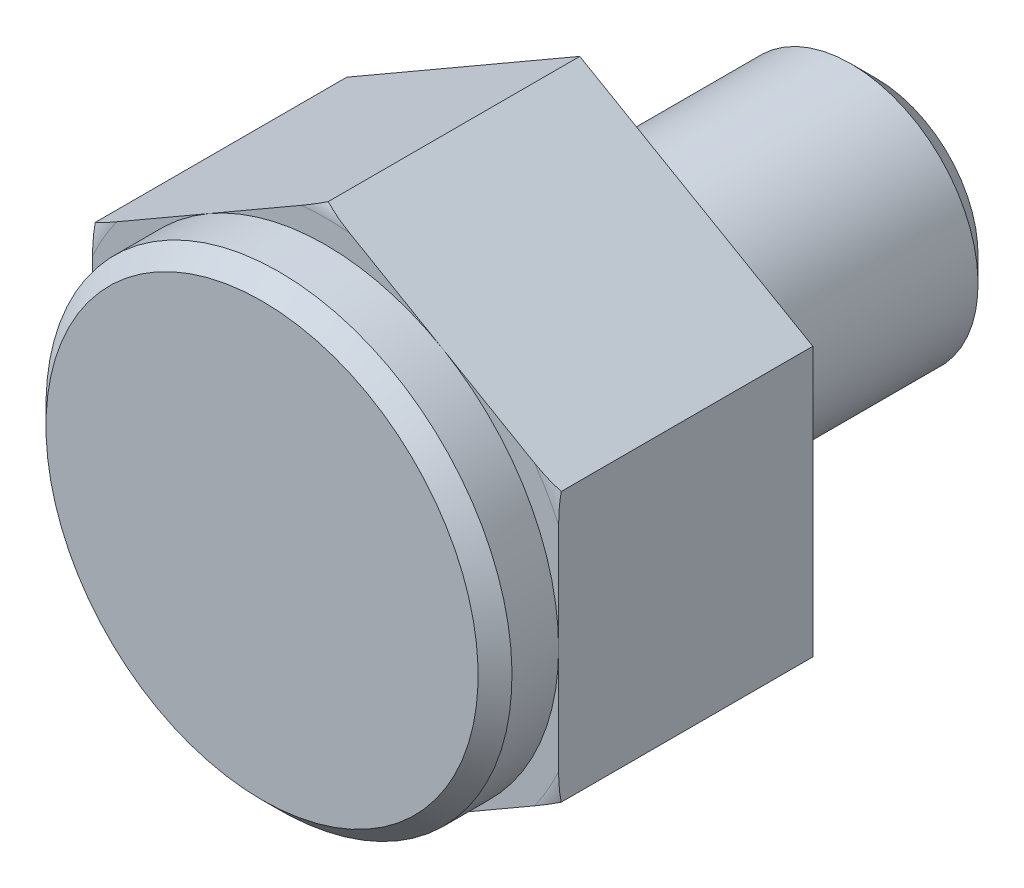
ISO-10303-21;
HEADER;
FILE_DESCRIPTION(('STEP AP214'),'2;1');
FILE_NAME('part.step','',(''),(''),'','','');
FILE_SCHEMA(('AUTOMOTIVE_DESIGN { 1 0 10303 214 1 1 1 1 }'));
ENDSEC;
DATA;
#1=APPLICATION_CONTEXT('core data for automotive mechanical design processes');
#2=APPLICATION_PROTOCOL_DEFINITION('international standard','automotive_design',2000,#1);
#3=PRODUCT_CONTEXT('',#1,'mechanical');
#4=PRODUCT('Part','Part','',(#3));
#5=PRODUCT_RELATED_PRODUCT_CATEGORY('part','',(#4));
#6=PRODUCT_DEFINITION_FORMATION('','',#4);
#7=PRODUCT_DEFINITION_CONTEXT('part definition',#1,'design');
#8=PRODUCT_DEFINITION('design','',#6,#7);
#9=PRODUCT_DEFINITION_SHAPE('','',#8);
#10=(LENGTH_UNIT() NAMED_UNIT(*) SI_UNIT(.MILLI.,.METRE.));
#11=(NAMED_UNIT(*) PLANE_ANGLE_UNIT() SI_UNIT($,.RADIAN.));
#12=(NAMED_UNIT(*) SI_UNIT($,.STERADIAN.) SOLID_ANGLE_UNIT());
#13=UNCERTAINTY_MEASURE_WITH_UNIT(LENGTH_MEASURE(1.E-05),#10,'distance_accuracy_value','');
#14=(GEOMETRIC_REPRESENTATION_CONTEXT(3) GLOBAL_UNCERTAINTY_ASSIGNED_CONTEXT((#13)) GLOBAL_UNIT_ASSIGNED_CONTEXT((#10,
#11,#12)) REPRESENTATION_CONTEXT('',''));
#15=CARTESIAN_POINT('',(0.,0.,0.));
#16=DIRECTION('',(0.,0.,1.));
#17=DIRECTION('',(1.,0.,0.));
#18=AXIS2_PLACEMENT_3D('',#15,#16,#17);
#19=CARTESIAN_POINT('',(13.6,0.,0.));
#20=DIRECTION('',(0.,0.,-1.));
#21=DIRECTION('',(0.,1.,0.));
#22=AXIS2_PLACEMENT_3D('',#19,#20,#21);
#23=PLANE('',#22);
#24=CARTESIAN_POINT('',(0.,0.,0.));
#25=DIRECTION('',(0.,0.,-1.));
#26=DIRECTION('',(0.,1.,0.));
#27=AXIS2_PLACEMENT_3D('',#24,#25,#26);
#28=CIRCLE('',#27,4.8);
#29=CARTESIAN_POINT('',(0.,4.8,0.));
#30=VERTEX_POINT('',#29);
#31=EDGE_CURVE('E175',#30,#30,#28,.T.);
#32=ORIENTED_EDGE('',*,*,#31,.F.);
#33=EDGE_LOOP('',(#32));
#34=FACE_BOUND('',#33,.T.);
#35=DIRECTION('',(0.,1.,0.));
#36=VECTOR('',#35,1.);
#37=CARTESIAN_POINT('',(-11.,0.,0.));
#38=LINE('',#37,#36);
#39=CARTESIAN_POINT('',(-11.,-6.3508529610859,0.));
#40=VERTEX_POINT('',#39);
#41=CARTESIAN_POINT('',(-11.,6.3508529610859,0.));
#42=VERTEX_POINT('',#41);
#43=EDGE_CURVE('E192',#40,#42,#38,.T.);
#44=ORIENTED_EDGE('',*,*,#43,.T.);
#45=DIRECTION('',(0.866025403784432,0.500000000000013,0.));
#46=VECTOR('',#45,1.);
#47=CARTESIAN_POINT('',(4.69999999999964,15.4152521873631,0.));
#48=LINE('',#47,#46);
#49=CARTESIAN_POINT('',(0.,12.701705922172,0.));
#50=VERTEX_POINT('',#49);
#51=EDGE_CURVE('E9',#42,#50,#48,.T.);
#52=ORIENTED_EDGE('',*,*,#51,.T.);
#53=DIRECTION('',(0.866025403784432,-0.500000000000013,0.));
#54=VECTOR('',#53,1.);
#55=CARTESIAN_POINT('',(15.7,3.63730669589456,0.));
#56=LINE('',#55,#54);
#57=CARTESIAN_POINT('',(11.,6.3508529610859,0.));
#58=VERTEX_POINT('',#57);
#59=EDGE_CURVE('E22',#50,#58,#56,.T.);
#60=ORIENTED_EDGE('',*,*,#59,.T.);
#61=DIRECTION('',(0.,-1.,0.));
#62=VECTOR('',#61,1.);
#63=CARTESIAN_POINT('',(11.,0.,0.));
#64=LINE('',#63,#62);
#65=CARTESIAN_POINT('',(11.,-6.3508529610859,0.));
#66=VERTEX_POINT('',#65);
#67=EDGE_CURVE('E200',#58,#66,#64,.T.);
#68=ORIENTED_EDGE('',*,*,#67,.T.);
#69=DIRECTION('',(-0.866025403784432,-0.500000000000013,0.));
#70=VECTOR('',#69,1.);
#71=CARTESIAN_POINT('',(15.7,-3.63730669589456,0.));
#72=LINE('',#71,#70);
#73=CARTESIAN_POINT('',(0.,-12.701705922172,0.));
#74=VERTEX_POINT('',#73);
#75=EDGE_CURVE('E197',#66,#74,#72,.T.);
#76=ORIENTED_EDGE('',*,*,#75,.T.);
#77=DIRECTION('',(-0.866025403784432,0.500000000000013,0.));
#78=VECTOR('',#77,1.);
#79=CARTESIAN_POINT('',(4.69999999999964,-15.4152521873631,0.));
#80=LINE('',#79,#78);
#81=EDGE_CURVE('E194',#74,#40,#80,.T.);
#82=ORIENTED_EDGE('',*,*,#81,.T.);
#83=EDGE_LOOP('',(#44,#52,#60,#68,#76,#82));
#84=FACE_BOUND('',#83,.T.);
#85=ADVANCED_FACE('F14',(#34,#84),#23,.T.);
#86=CARTESIAN_POINT('',(0.,0.,-14.));
#87=DIRECTION('',(0.,0.,-1.));
#88=DIRECTION('',(0.,1.,0.));
#89=AXIS2_PLACEMENT_3D('',#86,#87,#88);
#90=CYLINDRICAL_SURFACE('',#89,4.8);
#91=ORIENTED_EDGE('',*,*,#31,.T.);
#92=EDGE_LOOP('',(#91));
#93=FACE_BOUND('',#92,.T.);
#94=CARTESIAN_POINT('',(0.,0.,-1.875));
#95=DIRECTION('',(0.,0.,-1.));
#96=DIRECTION('',(0.,1.,0.));
#97=AXIS2_PLACEMENT_3D('',#94,#95,#96);
#98=CIRCLE('',#97,4.8);
#99=CARTESIAN_POINT('',(0.,4.8,-1.875));
#100=VERTEX_POINT('',#99);
#101=EDGE_CURVE('E172',#100,#100,#98,.T.);
#102=ORIENTED_EDGE('',*,*,#101,.F.);
#103=EDGE_LOOP('',(#102));
#104=FACE_BOUND('',#103,.T.);
#105=ADVANCED_FACE('F254',(#93,#104),#90,.T.);
#106=CARTESIAN_POINT('',(0.,0.,-3.075));
#107=DIRECTION('',(0.,0.,-1.));
#108=DIRECTION('',(0.,1.,0.));
#109=AXIS2_PLACEMENT_3D('',#106,#107,#108);
#110=CONICAL_SURFACE('',#109,6.,0.785398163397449);
#111=ORIENTED_EDGE('',*,*,#101,.T.);
#112=EDGE_LOOP('',(#111));
#113=FACE_BOUND('',#112,.T.);
#114=CARTESIAN_POINT('',(0.,0.,-3.075));
#115=DIRECTION('',(0.,0.,-1.));
#116=DIRECTION('',(0.,1.,0.));
#117=AXIS2_PLACEMENT_3D('',#114,#115,#116);
#118=CIRCLE('',#117,6.);
#119=CARTESIAN_POINT('',(0.,6.,-3.075));
#120=VERTEX_POINT('',#119);
#121=EDGE_CURVE('E169',#120,#120,#118,.T.);
#122=ORIENTED_EDGE('',*,*,#121,.F.);
#123=EDGE_LOOP('',(#122));
#124=FACE_BOUND('',#123,.T.);
#125=ADVANCED_FACE('F250',(#113,#124),#110,.T.);
#126=CARTESIAN_POINT('',(0.,0.,-14.));
#127=DIRECTION('',(0.,0.,-1.));
#128=DIRECTION('',(0.,1.,0.));
#129=AXIS2_PLACEMENT_3D('',#126,#127,#128);
#130=CYLINDRICAL_SURFACE('',#129,6.);
#131=ORIENTED_EDGE('',*,*,#121,.T.);
#132=EDGE_LOOP('',(#131));
#133=FACE_BOUND('',#132,.T.);
#134=CARTESIAN_POINT('',(0.,0.,-12.8));
#135=DIRECTION('',(0.,0.,-1.));
#136=DIRECTION('',(0.,1.,0.));
#137=AXIS2_PLACEMENT_3D('',#134,#135,#136);
#138=CIRCLE('',#137,6.);
#139=CARTESIAN_POINT('',(0.,6.,-12.8));
#140=VERTEX_POINT('',#139);
#141=EDGE_CURVE('E160',#140,#140,#138,.T.);
#142=ORIENTED_EDGE('',*,*,#141,.F.);
#143=EDGE_LOOP('',(#142));
#144=FACE_BOUND('',#143,.T.);
#145=ADVANCED_FACE('F246',(#133,#144),#130,.T.);
#146=CARTESIAN_POINT('',(0.,0.,-14.));
#147=DIRECTION('',(0.,0.,1.));
#148=DIRECTION('',(0.,-1.,0.));
#149=AXIS2_PLACEMENT_3D('',#146,#147,#148);
#150=CONICAL_SURFACE('',#149,4.8,0.785398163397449);
#151=ORIENTED_EDGE('',*,*,#141,.T.);
#152=EDGE_LOOP('',(#151));
#153=FACE_BOUND('',#152,.T.);
#154=CARTESIAN_POINT('',(0.,0.,-14.));
#155=DIRECTION('',(0.,0.,-1.));
#156=DIRECTION('',(0.,1.,0.));
#157=AXIS2_PLACEMENT_3D('',#154,#155,#156);
#158=CIRCLE('',#157,4.8);
#159=CARTESIAN_POINT('',(0.,4.8,-14.));
#160=VERTEX_POINT('',#159);
#161=EDGE_CURVE('E154',#160,#160,#158,.T.);
#162=ORIENTED_EDGE('',*,*,#161,.F.);
#163=EDGE_LOOP('',(#162));
#164=FACE_BOUND('',#163,.T.);
#165=ADVANCED_FACE('F242',(#153,#164),#150,.T.);
#166=CARTESIAN_POINT('',(4.8,0.,-14.));
#167=DIRECTION('',(0.,0.,-1.));
#168=DIRECTION('',(0.,1.,0.));
#169=AXIS2_PLACEMENT_3D('',#166,#167,#168);
#170=PLANE('',#169);
#171=ORIENTED_EDGE('',*,*,#161,.T.);
#172=EDGE_LOOP('',(#171));
#173=FACE_BOUND('',#172,.T.);
#174=ADVANCED_FACE('F239',(#173),#170,.T.);
#175=CARTESIAN_POINT('',(0.,12.701705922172,-4.));
#176=DIRECTION('',(-0.500000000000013,0.866025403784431,0.));
#177=DIRECTION('',(-0.866025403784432,-0.500000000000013,0.));
#178=AXIS2_PLACEMENT_3D('',#175,#176,#177);
#179=PLANE('',#178);
#180=DIRECTION('',(0.,0.,1.));
#181=VECTOR('',#180,1.);
#182=CARTESIAN_POINT('',(0.,12.701705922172,-4.));
#183=LINE('',#182,#181);
#184=CARTESIAN_POINT('',(0.,12.701705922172,11.8740269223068));
#185=VERTEX_POINT('',#184);
#186=EDGE_CURVE('E123',#50,#185,#183,.T.);
#187=ORIENTED_EDGE('',*,*,#186,.F.);
#188=ORIENTED_EDGE('',*,*,#51,.F.);
#189=DIRECTION('',(0.,0.,1.));
#190=VECTOR('',#189,1.);
#191=CARTESIAN_POINT('',(-11.,6.3508529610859,-4.));
#192=LINE('',#191,#190);
#193=CARTESIAN_POINT('',(-11.,6.3508529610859,11.8740269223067));
#194=VERTEX_POINT('',#193);
#195=EDGE_CURVE('E35',#42,#194,#192,.T.);
#196=ORIENTED_EDGE('',*,*,#195,.T.);
#197=CARTESIAN_POINT('',(0.00019999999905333,12.7018213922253,11.8739763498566));
#198=CARTESIAN_POINT('',(-0.0759655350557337,12.6578472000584,11.8932144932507));
#199=CARTESIAN_POINT('',(-0.15259819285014,12.6136033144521,11.9098037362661));
#200=CARTESIAN_POINT('',(-0.306462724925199,12.5247695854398,11.9382785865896));
#201=CARTESIAN_POINT('',(-0.383694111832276,12.4801800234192,11.9501676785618));
#202=CARTESIAN_POINT('',(-0.538344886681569,12.3908923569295,11.9698389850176));
#203=CARTESIAN_POINT('',(-0.615763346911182,12.3461947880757,11.9776312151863));
#204=CARTESIAN_POINT('',(-0.770817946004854,12.2566739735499,11.9896427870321));
#205=CARTESIAN_POINT('',(-0.848454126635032,12.2118507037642,11.993861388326));
#206=CARTESIAN_POINT('',(-1.08077641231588,12.0777193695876,12.0017958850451));
#207=CARTESIAN_POINT('',(-1.23558448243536,11.9883408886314,12.0008718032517));
#208=CARTESIAN_POINT('',(-1.54495232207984,11.809727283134,11.9895091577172));
#209=CARTESIAN_POINT('',(-1.699511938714,11.7204922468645,11.9790660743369));
#210=CARTESIAN_POINT('',(-2.04297996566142,11.5221908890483,11.9479275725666));
#211=CARTESIAN_POINT('',(-2.23176228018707,11.4131973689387,11.9254493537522));
#212=CARTESIAN_POINT('',(-2.60864805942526,11.1956022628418,11.8738495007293));
#213=CARTESIAN_POINT('',(-2.79675134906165,11.0870007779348,11.8447262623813));
#214=CARTESIAN_POINT('',(-3.17274275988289,10.8699220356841,11.7837487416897));
#215=CARTESIAN_POINT('',(-3.36063065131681,10.7614449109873,11.7518926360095));
#216=CARTESIAN_POINT('',(-3.73661012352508,10.544373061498,11.689688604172));
#217=CARTESIAN_POINT('',(-3.92470171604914,10.435778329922,11.6593407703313));
#218=CARTESIAN_POINT('',(-4.30313710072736,10.2172885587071,11.604642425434));
#219=CARTESIAN_POINT('',(-4.49348680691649,10.1073901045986,11.5803423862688));
#220=CARTESIAN_POINT('',(-4.77960217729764,9.94220131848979,11.5521958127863));
#221=CARTESIAN_POINT('',(-4.87505681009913,9.88709056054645,11.5441981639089));
#222=CARTESIAN_POINT('',(-5.06612511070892,9.77677722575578,11.531425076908));
#223=CARTESIAN_POINT('',(-5.16173876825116,9.72157465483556,11.526649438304));
#224=CARTESIAN_POINT('',(-5.35295376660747,9.61117662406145,11.5206285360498));
#225=CARTESIAN_POINT('',(-5.44855502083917,9.55598121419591,11.519379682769));
#226=CARTESIAN_POINT('',(-5.63974179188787,9.44559948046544,11.5204829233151));
#227=CARTESIAN_POINT('',(-5.73532730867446,9.39041315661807,11.5228350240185));
#228=CARTESIAN_POINT('',(-5.92641346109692,9.28008951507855,11.5309890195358));
#229=CARTESIAN_POINT('',(-6.02191406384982,9.22495221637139,11.5367919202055));
#230=CARTESIAN_POINT('',(-6.21273935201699,9.11477918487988,11.5514865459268));
#231=CARTESIAN_POINT('',(-6.30806402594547,9.05974345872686,11.5603784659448));
#232=CARTESIAN_POINT('',(-6.5909186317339,8.89643727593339,11.5906412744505));
#233=CARTESIAN_POINT('',(-6.77814355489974,8.78834291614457,11.6157476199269));
#234=CARTESIAN_POINT('',(-7.15192651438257,8.57253922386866,11.6714173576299));
#235=CARTESIAN_POINT('',(-7.33848458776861,8.46482986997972,11.7019804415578));
#236=CARTESIAN_POINT('',(-7.71145320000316,8.24949634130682,11.76402059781));
#237=CARTESIAN_POINT('',(-7.89786375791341,8.14187215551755,11.7954975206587));
#238=CARTESIAN_POINT('',(-8.27115350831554,7.92635321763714,11.8553087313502));
#239=CARTESIAN_POINT('',(-8.45803285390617,7.8184583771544,11.8836418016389));
#240=CARTESIAN_POINT('',(-8.83976892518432,7.59806295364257,11.9342695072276));
#241=CARTESIAN_POINT('',(-9.03465435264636,7.48554579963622,11.956287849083));
#242=CARTESIAN_POINT('',(-9.42499791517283,7.26018083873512,11.9883177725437));
#243=CARTESIAN_POINT('',(-9.6204548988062,7.14733369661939,11.9983457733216));
#244=CARTESIAN_POINT('',(-9.91500664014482,6.97727416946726,12.0005556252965));
#245=CARTESIAN_POINT('',(-10.014063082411,6.9200839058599,11.9991015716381));
#246=CARTESIAN_POINT('',(-10.2119908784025,6.80581023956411,11.9909854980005));
#247=CARTESIAN_POINT('',(-10.3108622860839,6.74872680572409,11.9843253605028));
#248=CARTESIAN_POINT('',(-10.5086738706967,6.63452023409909,11.9648199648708));
#249=CARTESIAN_POINT('',(-10.6076118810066,6.57739834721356,11.9519436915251));
#250=CARTESIAN_POINT('',(-10.7553845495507,6.49208175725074,11.9271182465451));
#251=CARTESIAN_POINT('',(-10.8045689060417,6.46368515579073,11.9179166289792));
#252=CARTESIAN_POINT('',(-10.9026349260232,6.40706671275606,11.8974999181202));
#253=CARTESIAN_POINT('',(-10.9515165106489,6.37884491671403,11.8862843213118));
#254=CARTESIAN_POINT('',(-11.0002,6.35073749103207,11.8739763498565));
#255=B_SPLINE_CURVE_WITH_KNOTS('',3,(#197,#198,#199,#200,#201,#202,#203,#204,#205,#206,#207,
#208,#209,#210,#211,#212,#213,#214,#215,#216,#217,#218,#219,#220,#221,#222,#223,#224,#225,#226,
#227,#228,#229,#230,#231,#232,#233,#234,#235,#236,#237,#238,#239,#240,#241,#242,#243,#244,#245,
#246,#247,#248,#249,#250,#251,#252,#253,#254),.UNSPECIFIED.,.F.,.F.,(4,2,2,2,2,2,2,2,2,2,2,2,2,
2,2,2,2,2,2,2,2,2,2,2,2,2,2,2,4),(0.,0.269986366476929,0.539772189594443,0.808895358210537,
1.07807427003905,1.61397266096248,2.15012563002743,2.8073681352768,3.46476947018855,
4.12261287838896,4.78049650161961,5.44369909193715,5.77519220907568,6.10666469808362,
6.43779968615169,6.76893530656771,7.10016749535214,7.43142059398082,8.08417886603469,
8.73690026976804,9.38951550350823,10.0423826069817,10.7205292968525,11.3977462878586,
11.7408195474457,12.0837688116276,12.4284471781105,12.6010162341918,12.7736284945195),.UNSPECIFIED.);
#256=CARTESIAN_POINT('',(-9.86548966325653,7.00586280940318,12.));
#257=VERTEX_POINT('',#256);
#258=EDGE_CURVE('E129',#257,#194,#255,.T.);
#259=ORIENTED_EDGE('',*,*,#258,.F.);
#260=DIRECTION('',(-0.866025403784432,-0.500000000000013,0.));
#261=VECTOR('',#260,1.);
#262=CARTESIAN_POINT('',(2.74999999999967,14.2894191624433,12.));
#263=LINE('',#262,#261);
#264=CARTESIAN_POINT('',(-5.5000000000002,9.52627944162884,12.));
#265=VERTEX_POINT('',#264);
#266=EDGE_CURVE('E136',#265,#257,#263,.T.);
#267=ORIENTED_EDGE('',*,*,#266,.F.);
#268=CARTESIAN_POINT('',(-1.13451033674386,12.0466960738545,12.));
#269=VERTEX_POINT('',#268);
#270=EDGE_CURVE('E140',#269,#265,#263,.T.);
#271=ORIENTED_EDGE('',*,*,#270,.F.);
#272=EDGE_CURVE('E139',#185,#269,#255,.T.);
#273=ORIENTED_EDGE('',*,*,#272,.F.);
#274=EDGE_LOOP('',(#187,#188,#196,#259,#267,#271,#273));
#275=FACE_BOUND('',#274,.T.);
#276=ADVANCED_FACE('F128',(#275),#179,.T.);
#277=CARTESIAN_POINT('',(11.,6.3508529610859,-4.));
#278=DIRECTION('',(0.500000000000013,0.866025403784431,0.));
#279=DIRECTION('',(-0.866025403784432,0.500000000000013,0.));
#280=AXIS2_PLACEMENT_3D('',#277,#278,#279);
#281=PLANE('',#280);
#282=DIRECTION('',(0.,0.,1.));
#283=VECTOR('',#282,1.);
#284=CARTESIAN_POINT('',(11.,6.3508529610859,-4.));
#285=LINE('',#284,#283);
#286=CARTESIAN_POINT('',(11.,6.3508529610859,11.8740269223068));
#287=VERTEX_POINT('',#286);
#288=EDGE_CURVE('E209',#58,#287,#285,.T.);
#289=ORIENTED_EDGE('',*,*,#288,.F.);
#290=ORIENTED_EDGE('',*,*,#59,.F.);
#291=ORIENTED_EDGE('',*,*,#186,.T.);
#292=CARTESIAN_POINT('',(11.0002,6.35073749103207,11.8739763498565));
#293=CARTESIAN_POINT('',(10.9240344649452,6.39471168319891,11.8932144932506));
#294=CARTESIAN_POINT('',(10.8474018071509,6.43895556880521,11.9098037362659));
#295=CARTESIAN_POINT('',(10.6935372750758,6.52778929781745,11.9382785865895));
#296=CARTESIAN_POINT('',(10.6163058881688,6.57237885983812,11.9501676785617));
#297=CARTESIAN_POINT('',(10.4616551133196,6.66166652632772,11.9698389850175));
#298=CARTESIAN_POINT('',(10.38423665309,6.70636409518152,11.9776312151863));
#299=CARTESIAN_POINT('',(10.2291820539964,6.79588490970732,11.9896427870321));
#300=CARTESIAN_POINT('',(10.1515458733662,6.84070817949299,11.993861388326));
#301=CARTESIAN_POINT('',(9.91922358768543,6.97483951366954,12.0017958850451));
#302=CARTESIAN_POINT('',(9.764415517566,7.06421799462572,12.0008718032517));
#303=CARTESIAN_POINT('',(9.45504767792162,7.24283160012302,11.9895091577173));
#304=CARTESIAN_POINT('',(9.30048806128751,7.33206663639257,11.979066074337));
#305=CARTESIAN_POINT('',(8.95702003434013,7.53036799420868,11.9479275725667));
#306=CARTESIAN_POINT('',(8.76823771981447,7.63936151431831,11.9254493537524));
#307=CARTESIAN_POINT('',(8.39135194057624,7.85695662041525,11.8738495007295));
#308=CARTESIAN_POINT('',(8.20324865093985,7.96555810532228,11.8447262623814));
#309=CARTESIAN_POINT('',(7.82725724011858,8.18263684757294,11.7837487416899));
#310=CARTESIAN_POINT('',(7.63936934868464,8.29111397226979,11.7518926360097));
#311=CARTESIAN_POINT('',(7.26338987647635,8.50818582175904,11.6896886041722));
#312=CARTESIAN_POINT('',(7.07529828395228,8.61678055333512,11.6593407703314));
#313=CARTESIAN_POINT('',(6.69686289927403,8.83527032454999,11.6046424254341));
#314=CARTESIAN_POINT('',(6.50651319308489,8.94516877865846,11.5803423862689));
#315=CARTESIAN_POINT('',(6.22039782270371,9.11035756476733,11.5521958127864));
#316=CARTESIAN_POINT('',(6.12494318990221,9.16546832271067,11.5441981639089));
#317=CARTESIAN_POINT('',(5.93387488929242,9.27578165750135,11.531425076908));
#318=CARTESIAN_POINT('',(5.83826123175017,9.33098422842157,11.526649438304));
#319=CARTESIAN_POINT('',(5.64704623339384,9.4413822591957,11.5206285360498));
#320=CARTESIAN_POINT('',(5.55144497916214,9.49657766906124,11.519379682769));
#321=CARTESIAN_POINT('',(5.36025820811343,9.60695940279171,11.5204829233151));
#322=CARTESIAN_POINT('',(5.26467269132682,9.66214572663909,11.5228350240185));
#323=CARTESIAN_POINT('',(5.07358653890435,9.77246936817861,11.5309890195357));
#324=CARTESIAN_POINT('',(4.97808593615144,9.82760666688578,11.5367919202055));
#325=CARTESIAN_POINT('',(4.78726064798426,9.93777969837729,11.5514865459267));
#326=CARTESIAN_POINT('',(4.69193597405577,9.99281542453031,11.5603784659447));
#327=CARTESIAN_POINT('',(4.40908136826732,10.1561216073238,11.5906412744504));
#328=CARTESIAN_POINT('',(4.22185644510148,10.2642159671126,11.6157476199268));
#329=CARTESIAN_POINT('',(3.84807348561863,10.4800196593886,11.6714173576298));
#330=CARTESIAN_POINT('',(3.66151541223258,10.5877290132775,11.7019804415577));
#331=CARTESIAN_POINT('',(3.28854679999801,10.8030625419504,11.7640205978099));
#332=CARTESIAN_POINT('',(3.10213624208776,10.9106867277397,11.7954975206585));
#333=CARTESIAN_POINT('',(2.72884649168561,11.1262056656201,11.8553087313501));
#334=CARTESIAN_POINT('',(2.54196714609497,11.2341005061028,11.8836418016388));
#335=CARTESIAN_POINT('',(2.16023107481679,11.4544959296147,11.9342695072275));
#336=CARTESIAN_POINT('',(1.96534564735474,11.567013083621,11.9562878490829));
#337=CARTESIAN_POINT('',(1.57500208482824,11.7923780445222,11.9883177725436));
#338=CARTESIAN_POINT('',(1.37954510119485,11.9052251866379,11.9983457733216));
#339=CARTESIAN_POINT('',(1.0849933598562,12.07528471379,12.0005556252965));
#340=CARTESIAN_POINT('',(0.985936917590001,12.1324749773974,11.9991015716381));
#341=CARTESIAN_POINT('',(0.788009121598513,12.2467486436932,11.9909854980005));
#342=CARTESIAN_POINT('',(0.689137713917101,12.3038320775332,11.9843253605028));
#343=CARTESIAN_POINT('',(0.491326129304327,12.4180386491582,11.9648199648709));
#344=CARTESIAN_POINT('',(0.392388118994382,12.4751605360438,11.9519436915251));
#345=CARTESIAN_POINT('',(0.244615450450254,12.5604771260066,11.9271182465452));
#346=CARTESIAN_POINT('',(0.195431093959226,12.5888737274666,11.9179166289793));
#347=CARTESIAN_POINT('',(0.0973650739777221,12.6454921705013,11.8974999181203));
#348=CARTESIAN_POINT('',(0.0484834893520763,12.6737139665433,11.8862843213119));
#349=CARTESIAN_POINT('',(-0.000199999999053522,12.7018213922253,11.8739763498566));
#350=B_SPLINE_CURVE_WITH_KNOTS('',3,(#292,#293,#294,#295,#296,#297,#298,#299,#300,#301,#302,
#303,#304,#305,#306,#307,#308,#309,#310,#311,#312,#313,#314,#315,#316,#317,#318,#319,#320,#321,
#322,#323,#324,#325,#326,#327,#328,#329,#330,#331,#332,#333,#334,#335,#336,#337,#338,#339,#340,
#341,#342,#343,#344,#345,#346,#347,#348,#349),.UNSPECIFIED.,.F.,.F.,(4,2,2,2,2,2,2,2,2,2,2,2,2,
2,2,2,2,2,2,2,2,2,2,2,2,2,2,2,4),(0.,0.26998636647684,0.539772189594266,0.808895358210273,
1.0780742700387,1.61397266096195,2.15012563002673,2.80736813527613,3.46476947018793,
4.12261287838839,4.78049650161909,5.44369909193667,5.77519220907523,6.1066646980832,
6.43779968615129,6.76893530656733,7.10016749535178,7.43142059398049,8.08417886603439,
8.73690026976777,9.38951550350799,10.0423826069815,10.7205292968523,11.3977462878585,
11.7408195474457,12.0837688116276,12.4284471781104,12.6010162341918,12.7736284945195),.UNSPECIFIED.);
#351=CARTESIAN_POINT('',(1.13451033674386,12.0466960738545,12.));
#352=VERTEX_POINT('',#351);
#353=EDGE_CURVE('E145',#352,#185,#350,.T.);
#354=ORIENTED_EDGE('',*,*,#353,.F.);
#355=DIRECTION('',(-0.866025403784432,0.500000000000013,0.));
#356=VECTOR('',#355,1.);
#357=CARTESIAN_POINT('',(13.75,4.76313972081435,12.));
#358=LINE('',#357,#356);
#359=CARTESIAN_POINT('',(5.5000000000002,9.52627944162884,12.));
#360=VERTEX_POINT('',#359);
#361=EDGE_CURVE('E491',#360,#352,#358,.T.);
#362=ORIENTED_EDGE('',*,*,#361,.F.);
#363=CARTESIAN_POINT('',(9.86548966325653,7.00586280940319,12.));
#364=VERTEX_POINT('',#363);
#365=EDGE_CURVE('E143',#364,#360,#358,.T.);
#366=ORIENTED_EDGE('',*,*,#365,.F.);
#367=EDGE_CURVE('E137',#287,#364,#350,.T.);
#368=ORIENTED_EDGE('',*,*,#367,.F.);
#369=EDGE_LOOP('',(#289,#290,#291,#354,#362,#366,#368));
#370=FACE_BOUND('',#369,.T.);
#371=ADVANCED_FACE('F207',(#370),#281,.T.);
#372=CARTESIAN_POINT('',(11.,-6.3508529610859,-4.));
#373=DIRECTION('',(1.,0.,0.));
#374=DIRECTION('',(0.,1.,0.));
#375=AXIS2_PLACEMENT_3D('',#372,#373,#374);
#376=PLANE('',#375);
#377=DIRECTION('',(0.,1.,0.));
#378=VECTOR('',#377,1.);
#379=CARTESIAN_POINT('',(11.,0.,12.));
#380=LINE('',#379,#378);
#381=CARTESIAN_POINT('',(11.,-5.04083326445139,12.0000000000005));
#382=VERTEX_POINT('',#381);
#383=CARTESIAN_POINT('',(11.,0.,12.));
#384=VERTEX_POINT('',#383);
#385=EDGE_CURVE('E496',#382,#384,#380,.T.);
#386=ORIENTED_EDGE('',*,*,#385,.F.);
#387=CARTESIAN_POINT('',(11.,0.,11.5198039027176));
#388=CARTESIAN_POINT('',(11.,0.124987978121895,11.5197973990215));
#389=CARTESIAN_POINT('',(11.,0.249971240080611,11.5221161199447));
#390=CARTESIAN_POINT('',(11.,0.499780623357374,11.53118204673));
#391=CARTESIAN_POINT('',(11.,0.624606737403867,11.5379294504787));
#392=CARTESIAN_POINT('',(11.,0.87414017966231,11.5553369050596));
#393=CARTESIAN_POINT('',(11.,0.99884714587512,11.5660020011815));
#394=CARTESIAN_POINT('',(11.,1.24795610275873,11.5904785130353));
#395=CARTESIAN_POINT('',(11.,1.37235806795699,11.6042901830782));
#396=CARTESIAN_POINT('',(11.,1.74783905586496,11.6494516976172));
#397=CARTESIAN_POINT('',(11.,1.99848289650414,11.6843025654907));
#398=CARTESIAN_POINT('',(11.,2.4993108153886,11.756028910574));
#399=CARTESIAN_POINT('',(11.,2.74949506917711,11.7929032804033));
#400=CARTESIAN_POINT('',(11.,3.25081681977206,11.8622879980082));
#401=CARTESIAN_POINT('',(11.,3.50195511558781,11.8947928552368));
#402=CARTESIAN_POINT('',(11.,4.0056976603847,11.9493951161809));
#403=CARTESIAN_POINT('',(11.,4.25830298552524,11.9714835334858));
#404=CARTESIAN_POINT('',(11.,4.63678887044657,11.9918635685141));
#405=CARTESIAN_POINT('',(11.,4.76231729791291,11.9965386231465));
#406=CARTESIAN_POINT('',(11.,5.01345193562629,12.0008213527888));
#407=CARTESIAN_POINT('',(11.,5.13905812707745,12.0004299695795));
#408=CARTESIAN_POINT('',(11.,5.38991647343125,11.9935639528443));
#409=CARTESIAN_POINT('',(11.,5.51516887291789,11.9870990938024));
#410=CARTESIAN_POINT('',(11.,5.76506516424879,11.9669002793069));
#411=CARTESIAN_POINT('',(11.,5.8897093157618,11.9531697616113));
#412=CARTESIAN_POINT('',(11.,6.09072899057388,11.9238343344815));
#413=CARTESIAN_POINT('',(11.,6.16749728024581,11.9109112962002));
#414=CARTESIAN_POINT('',(11.,6.32031835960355,11.8812694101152));
#415=CARTESIAN_POINT('',(11.,6.39637104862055,11.8645500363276));
#416=CARTESIAN_POINT('',(11.,6.54751140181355,11.8268095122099));
#417=CARTESIAN_POINT('',(11.,6.62259781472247,11.8057832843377));
#418=CARTESIAN_POINT('',(11.,6.77122248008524,11.7588767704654));
#419=CARTESIAN_POINT('',(11.,6.84476115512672,11.7329978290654));
#420=CARTESIAN_POINT('',(11.,7.02539523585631,11.6616193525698));
#421=CARTESIAN_POINT('',(11.,7.13119219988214,11.6127319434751));
#422=CARTESIAN_POINT('',(11.,7.33457051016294,11.5000762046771));
#423=CARTESIAN_POINT('',(11.,7.43217165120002,11.4363452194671));
#424=CARTESIAN_POINT('',(11.,7.5786886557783,11.3189046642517));
#425=CARTESIAN_POINT('',(11.,7.6319630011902,11.2706622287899));
#426=CARTESIAN_POINT('',(11.,7.73091500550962,11.1668749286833));
#427=CARTESIAN_POINT('',(11.,7.77660232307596,11.1113395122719));
#428=CARTESIAN_POINT('',(11.,7.84945660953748,11.004744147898));
#429=CARTESIAN_POINT('',(11.,7.87849952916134,10.954977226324));
#430=CARTESIAN_POINT('',(11.,7.9280558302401,10.8513293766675));
#431=CARTESIAN_POINT('',(11.,7.94857551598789,10.7974515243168));
#432=CARTESIAN_POINT('',(11.,7.97955937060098,10.686338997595));
#433=CARTESIAN_POINT('',(11.,7.98993900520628,10.6290802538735));
#434=CARTESIAN_POINT('',(11.,7.99928295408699,10.5136433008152));
#435=CARTESIAN_POINT('',(11.,7.99825398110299,10.4554656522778));
#436=CARTESIAN_POINT('',(11.,7.9857922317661,10.347940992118));
#437=CARTESIAN_POINT('',(11.,7.97572694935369,10.2984277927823));
#438=CARTESIAN_POINT('',(11.,7.94783687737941,10.2016543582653));
#439=CARTESIAN_POINT('',(11.,7.93000911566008,10.1543949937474));
#440=CARTESIAN_POINT('',(11.,7.88102131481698,10.0485753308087));
#441=CARTESIAN_POINT('',(11.,7.84743067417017,9.99114361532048));
#442=CARTESIAN_POINT('',(11.,7.77141688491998,9.88248397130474));
#443=CARTESIAN_POINT('',(11.,7.72897788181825,9.83126744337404));
#444=CARTESIAN_POINT('',(11.,7.61600405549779,9.7123506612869));
#445=CARTESIAN_POINT('',(11.,7.54166562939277,9.64828801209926));
#446=CARTESIAN_POINT('',(11.,7.3840867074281,9.53227460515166));
#447=CARTESIAN_POINT('',(11.,7.30082380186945,9.48035543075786));
#448=CARTESIAN_POINT('',(11.,7.14102746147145,9.39365920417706));
#449=CARTESIAN_POINT('',(11.,7.06523167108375,9.35749288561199));
#450=CARTESIAN_POINT('',(11.,6.91077524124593,9.29181744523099));
#451=CARTESIAN_POINT('',(11.,6.83211250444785,9.26231331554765));
#452=CARTESIAN_POINT('',(11.,6.67289153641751,9.20913084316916));
#453=CARTESIAN_POINT('',(11.,6.59233382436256,9.18545092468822));
#454=CARTESIAN_POINT('',(11.,6.42987926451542,9.14316279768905));
#455=CARTESIAN_POINT('',(11.,6.34798185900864,9.12455676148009));
#456=CARTESIAN_POINT('',(11.,6.16301093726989,9.0877648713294));
#457=CARTESIAN_POINT('',(11.,6.0596933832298,9.07081293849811));
#458=CARTESIAN_POINT('',(11.,5.85228467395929,9.04283246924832));
#459=CARTESIAN_POINT('',(11.,5.74819350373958,9.03180404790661));
#460=CARTESIAN_POINT('',(11.,5.43501708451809,9.0062894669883));
#461=CARTESIAN_POINT('',(11.,5.2253072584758,8.99942410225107));
#462=CARTESIAN_POINT('',(11.,4.80440402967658,9.00065361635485));
#463=CARTESIAN_POINT('',(11.,4.59321232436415,9.00886977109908));
#464=CARTESIAN_POINT('',(11.,4.17161774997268,9.03624436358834));
#465=CARTESIAN_POINT('',(11.,3.96121478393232,9.05540140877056));
#466=CARTESIAN_POINT('',(11.,3.48493378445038,9.10708422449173));
#467=CARTESIAN_POINT('',(11.,3.21930902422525,9.14181734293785));
#468=CARTESIAN_POINT('',(11.,2.68859494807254,9.21582823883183));
#469=CARTESIAN_POINT('',(11.,2.42350602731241,9.25510861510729));
#470=CARTESIAN_POINT('',(11.,1.89379558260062,9.33030536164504));
#471=CARTESIAN_POINT('',(11.,1.62917596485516,9.36623365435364));
#472=CARTESIAN_POINT('',(11.,1.23130640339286,9.41128472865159));
#473=CARTESIAN_POINT('',(11.,1.09857506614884,9.42482486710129));
#474=CARTESIAN_POINT('',(11.,0.832773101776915,9.44793857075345));
#475=CARTESIAN_POINT('',(11.,0.699702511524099,9.45751254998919));
#476=CARTESIAN_POINT('',(11.,0.433549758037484,9.47186189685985));
#477=CARTESIAN_POINT('',(11.,0.300468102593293,9.47664639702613));
#478=CARTESIAN_POINT('',(11.,0.0342188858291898,9.48100338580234));
#479=CARTESIAN_POINT('',(11.,-0.0989486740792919,9.48057595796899));
#480=CARTESIAN_POINT('',(11.,-0.365218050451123,9.47454783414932));
#481=CARTESIAN_POINT('',(11.,-0.498319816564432,9.46894498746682));
#482=CARTESIAN_POINT('',(11.,-0.764243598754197,9.4530835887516));
#483=CARTESIAN_POINT('',(11.,-0.897065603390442,9.44282484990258));
#484=CARTESIAN_POINT('',(11.,-1.29604325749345,9.40623694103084));
#485=CARTESIAN_POINT('',(11.,-1.56165044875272,9.37413207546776));
#486=CARTESIAN_POINT('',(11.,-2.09189035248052,9.30316033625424));
#487=CARTESIAN_POINT('',(11.,-2.35652293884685,9.26429261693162));
#488=CARTESIAN_POINT('',(11.,-2.75340306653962,9.20708058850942));
#489=CARTESIAN_POINT('',(11.,-2.8855670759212,9.18820786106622));
#490=CARTESIAN_POINT('',(11.,-3.15005565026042,9.1517218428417));
#491=CARTESIAN_POINT('',(11.,-3.28238020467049,9.13410847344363));
#492=CARTESIAN_POINT('',(11.,-3.67956151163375,9.08451562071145));
#493=CARTESIAN_POINT('',(11.,-3.9448659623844,9.05574547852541));
#494=CARTESIAN_POINT('',(11.,-4.34332266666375,9.02448193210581));
#495=CARTESIAN_POINT('',(11.,-4.47599831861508,9.0160470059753));
#496=CARTESIAN_POINT('',(11.,-4.74156311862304,9.00409403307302));
#497=CARTESIAN_POINT('',(11.,-4.8744522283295,9.00057518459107));
#498=CARTESIAN_POINT('',(11.,-5.1401471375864,8.99955421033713));
#499=CARTESIAN_POINT('',(11.,-5.27295290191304,9.00204657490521));
#500=CARTESIAN_POINT('',(11.,-5.5382078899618,9.01431349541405));
#501=CARTESIAN_POINT('',(11.,-5.6706572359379,9.0240851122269));
#502=CARTESIAN_POINT('',(11.,-5.90219354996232,9.04896821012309));
#503=CARTESIAN_POINT('',(11.,-6.00148277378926,9.06217807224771));
#504=CARTESIAN_POINT('',(11.,-6.19915458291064,9.09443005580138));
#505=CARTESIAN_POINT('',(11.,-6.29753694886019,9.11347355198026));
#506=CARTESIAN_POINT('',(11.,-6.49264594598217,9.15832543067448));
#507=CARTESIAN_POINT('',(11.,-6.58937447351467,9.18412542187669));
#508=CARTESIAN_POINT('',(11.,-6.7803264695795,9.24364950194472));
#509=CARTESIAN_POINT('',(11.,-6.87455189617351,9.2773671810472));
#510=CARTESIAN_POINT('',(11.,-7.05540127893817,9.35259232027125));
#511=CARTESIAN_POINT('',(11.,-7.14217852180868,9.39372560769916));
#512=CARTESIAN_POINT('',(11.,-7.31026557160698,9.48611789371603));
#513=CARTESIAN_POINT('',(11.,-7.39157776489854,9.53737243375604));
#514=CARTESIAN_POINT('',(11.,-7.53350894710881,9.6426631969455));
#515=CARTESIAN_POINT('',(11.,-7.5953727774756,9.6950003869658));
#516=CARTESIAN_POINT('',(11.,-7.71005005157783,9.80885427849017));
#517=CARTESIAN_POINT('',(11.,-7.76288116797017,9.87035260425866));
#518=CARTESIAN_POINT('',(11.,-7.84188713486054,9.98317010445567));
#519=CARTESIAN_POINT('',(11.,-7.8713355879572,10.0321850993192));
#520=CARTESIAN_POINT('',(11.,-7.92198542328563,10.134336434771));
#521=CARTESIAN_POINT('',(11.,-7.94319350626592,10.1874693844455));
#522=CARTESIAN_POINT('',(11.,-7.97585528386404,10.29719458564));
#523=CARTESIAN_POINT('',(11.,-7.98722616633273,10.3538119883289));
#524=CARTESIAN_POINT('',(11.,-7.9987823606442,10.4681763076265));
#525=CARTESIAN_POINT('',(11.,-7.99897431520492,10.5259225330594));
#526=CARTESIAN_POINT('',(11.,-7.98883538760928,10.6334221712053));
#527=CARTESIAN_POINT('',(11.,-7.97976836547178,10.6833009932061));
#528=CARTESIAN_POINT('',(11.,-7.95370417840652,10.780925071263));
#529=CARTESIAN_POINT('',(11.,-7.93670404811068,10.8286695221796));
#530=CARTESIAN_POINT('',(11.,-7.88993188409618,10.9345101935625));
#531=CARTESIAN_POINT('',(11.,-7.85788658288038,10.9915983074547));
#532=CARTESIAN_POINT('',(11.,-7.78497379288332,11.0998130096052));
#533=CARTESIAN_POINT('',(11.,-7.74409024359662,11.1509284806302));
#534=CARTESIAN_POINT('',(11.,-7.63543386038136,11.2692368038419));
#535=CARTESIAN_POINT('',(11.,-7.56394739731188,11.3329962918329));
#536=CARTESIAN_POINT('',(11.,-7.41208750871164,11.4487792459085));
#537=CARTESIAN_POINT('',(11.,-7.3316953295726,11.5007772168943));
#538=CARTESIAN_POINT('',(11.,-7.17775819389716,11.5875556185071));
#539=CARTESIAN_POINT('',(11.,-7.10499260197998,11.6237485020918));
#540=CARTESIAN_POINT('',(11.,-6.95658332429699,11.6897350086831));
#541=CARTESIAN_POINT('',(11.,-6.88093757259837,11.7195239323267));
#542=CARTESIAN_POINT('',(11.,-6.72760097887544,11.7735198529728));
#543=CARTESIAN_POINT('',(11.,-6.64990777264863,11.7977200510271));
#544=CARTESIAN_POINT('',(11.,-6.49314260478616,11.8411921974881));
#545=CARTESIAN_POINT('',(11.,-6.41407011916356,11.8604622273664));
#546=CARTESIAN_POINT('',(11.,-6.17498520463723,11.9118816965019));
#547=CARTESIAN_POINT('',(11.,-6.01355762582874,11.9374904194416));
#548=CARTESIAN_POINT('',(11.,-5.68908214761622,11.975098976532));
#549=CARTESIAN_POINT('',(11.,-5.5260325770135,11.9870828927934));
#550=CARTESIAN_POINT('',(11.,-5.19893892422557,12.0002875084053));
#551=CARTESIAN_POINT('',(11.,-5.03489339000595,12.0014684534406));
#552=CARTESIAN_POINT('',(11.,-4.70713535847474,11.9952858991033));
#553=CARTESIAN_POINT('',(11.,-4.54342269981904,11.9879292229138));
#554=CARTESIAN_POINT('',(11.,-4.19602458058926,11.9653040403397));
#555=CARTESIAN_POINT('',(11.,-4.01239884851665,11.9491619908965));
#556=CARTESIAN_POINT('',(11.,-3.64574950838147,11.9110118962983));
#557=CARTESIAN_POINT('',(11.,-3.46272602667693,11.8890026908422));
#558=CARTESIAN_POINT('',(11.,-3.09681597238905,11.8414100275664));
#559=CARTESIAN_POINT('',(11.,-2.91393027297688,11.8158200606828));
#560=CARTESIAN_POINT('',(11.,-2.54833575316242,11.7634917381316));
#561=CARTESIAN_POINT('',(11.,-2.36562692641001,11.7367534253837));
#562=CARTESIAN_POINT('',(11.,-2.0016554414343,11.6849390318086));
#563=CARTESIAN_POINT('',(11.,-1.82039467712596,11.6598500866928));
#564=CARTESIAN_POINT('',(11.,-1.45732831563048,11.6137998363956));
#565=CARTESIAN_POINT('',(11.,-1.27552272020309,11.5928385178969));
#566=CARTESIAN_POINT('',(11.,-0.911663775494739,11.5578450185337));
#567=CARTESIAN_POINT('',(11.,-0.729612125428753,11.5437959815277));
#568=CARTESIAN_POINT('',(11.,-0.365036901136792,11.5247810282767));
#569=CARTESIAN_POINT('',(11.,-0.182513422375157,11.5198133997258));
#570=CARTESIAN_POINT('',(11.,0.,11.5198039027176));
#571=B_SPLINE_CURVE_WITH_KNOTS('',3,(#387,#388,#389,#390,#391,#392,#393,#394,#395,#396,#397,
#398,#399,#400,#401,#402,#403,#404,#405,#406,#407,#408,#409,#410,#411,#412,#413,#414,#415,#416,
#417,#418,#419,#420,#421,#422,#423,#424,#425,#426,#427,#428,#429,#430,#431,#432,#433,#434,#435,
#436,#437,#438,#439,#440,#441,#442,#443,#444,#445,#446,#447,#448,#449,#450,#451,#452,#453,#454,
#455,#456,#457,#458,#459,#460,#461,#462,#463,#464,#465,#466,#467,#468,#469,#470,#471,#472,#473,
#474,#475,#476,#477,#478,#479,#480,#481,#482,#483,#484,#485,#486,#487,#488,#489,#490,#491,#492,
#493,#494,#495,#496,#497,#498,#499,#500,#501,#502,#503,#504,#505,#506,#507,#508,#509,#510,#511,
#512,#513,#514,#515,#516,#517,#518,#519,#520,#521,#522,#523,#524,#525,#526,#527,#528,#529,#530,
#531,#532,#533,#534,#535,#536,#537,#538,#539,#540,#541,#542,#543,#544,#545,#546,#547,#548,#549,
#550,#551,#552,#553,#554,#555,#556,#557,#558,#559,#560,#561,#562,#563,#564,#565,#566,#567,#568,
#569,#570),.UNSPECIFIED.,.T.,.F.,(4,2,2,2,2,2,2,2,2,2,2,2,2,2,2,2,2,2,2,2,2,2,2,2,2,2,2,2,2,2,2,
2,2,2,2,2,2,2,2,2,2,2,2,2,2,2,2,2,2,2,2,2,2,2,2,2,2,2,2,2,2,2,2,2,2,2,2,2,2,2,2,2,2,2,2,2,2,2,2,
2,2,2,2,2,2,2,2,2,2,2,2,4),(0.,0.374935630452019,0.749888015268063,1.12532497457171,
1.50079228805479,2.25987909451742,3.01855454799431,3.77817458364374,4.53844876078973,
4.91521441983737,5.29191004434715,5.66800046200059,6.0439130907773,6.27737897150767,
6.51087721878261,6.74465234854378,6.97836279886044,7.32710266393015,7.67497444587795,
7.89000028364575,8.10475024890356,8.276955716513,8.44903358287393,8.62253406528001,
8.79593246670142,8.94682791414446,9.09778118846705,9.29627711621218,9.49513181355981,
9.78789396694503,10.0814092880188,10.3329980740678,10.5847747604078,10.83648325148,
11.0882993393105,11.4021828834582,11.7160725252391,12.344696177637,12.9783969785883,
13.6120171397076,14.4155426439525,15.2195296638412,16.0205384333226,16.4207512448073,
16.8209222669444,17.2203287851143,17.6197289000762,18.019295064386,18.4188772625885,
19.22121785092,20.0236588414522,20.4241651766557,20.8246464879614,21.6248801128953,
22.0236397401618,22.4223343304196,22.8206636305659,23.2188321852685,23.5191818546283,
23.8196023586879,24.1196515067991,24.4194585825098,24.7070272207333,24.9944694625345,
25.2367994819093,25.4786498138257,25.6495716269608,25.8203541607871,25.9925607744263,
26.1646650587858,26.3160530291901,26.4674976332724,26.662815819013,26.8584919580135,
27.1442607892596,27.4306432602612,27.6741077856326,27.9177503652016,28.161687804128,
28.4057200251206,28.8952056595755,29.3852625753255,29.877122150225,30.3685889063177,
30.921449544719,31.474419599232,32.0284082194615,32.5823761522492,33.131325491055,
33.6802730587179,34.2278752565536,34.7753741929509),.UNSPECIFIED.);
#572=CARTESIAN_POINT('',(11.,-6.3508529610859,11.8740269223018));
#573=VERTEX_POINT('',#572);
#574=EDGE_CURVE('E505',#573,#382,#571,.T.);
#575=ORIENTED_EDGE('',*,*,#574,.F.);
#576=DIRECTION('',(0.,0.,1.));
#577=VECTOR('',#576,1.);
#578=CARTESIAN_POINT('',(11.,-6.3508529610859,-4.));
#579=LINE('',#578,#577);
#580=EDGE_CURVE('E211',#66,#573,#579,.T.);
#581=ORIENTED_EDGE('',*,*,#580,.F.);
#582=ORIENTED_EDGE('',*,*,#67,.F.);
#583=ORIENTED_EDGE('',*,*,#288,.T.);
#584=CARTESIAN_POINT('',(11.,5.04083326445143,12.));
#585=VERTEX_POINT('',#584);
#586=EDGE_CURVE('E494',#585,#287,#571,.T.);
#587=ORIENTED_EDGE('',*,*,#586,.F.);
#588=EDGE_CURVE('E492',#384,#585,#380,.T.);
#589=ORIENTED_EDGE('',*,*,#588,.F.);
#590=EDGE_LOOP('',(#386,#575,#581,#582,#583,#587,#589));
#591=FACE_BOUND('',#590,.T.);
#592=ADVANCED_FACE('F311',(#591),#376,.T.);
#593=CARTESIAN_POINT('',(0.,-12.701705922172,-4.));
#594=DIRECTION('',(0.500000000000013,-0.866025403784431,0.));
#595=DIRECTION('',(0.866025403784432,0.500000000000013,0.));
#596=AXIS2_PLACEMENT_3D('',#593,#594,#595);
#597=PLANE('',#596);
#598=DIRECTION('',(0.,0.,1.));
#599=VECTOR('',#598,1.);
#600=CARTESIAN_POINT('',(0.,-12.701705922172,-4.));
#601=LINE('',#600,#599);
#602=CARTESIAN_POINT('',(0.,-12.701705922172,11.8740269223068));
#603=VERTEX_POINT('',#602);
#604=EDGE_CURVE('E216',#74,#603,#601,.T.);
#605=ORIENTED_EDGE('',*,*,#604,.F.);
#606=ORIENTED_EDGE('',*,*,#75,.F.);
#607=ORIENTED_EDGE('',*,*,#580,.T.);
#608=CARTESIAN_POINT('',(-0.00019999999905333,-12.7018213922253,11.8739763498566));
#609=CARTESIAN_POINT('',(0.0759655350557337,-12.6578472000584,11.8932144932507));
#610=CARTESIAN_POINT('',(0.15259819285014,-12.6136033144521,11.9098037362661));
#611=CARTESIAN_POINT('',(0.306462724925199,-12.5247695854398,11.9382785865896));
#612=CARTESIAN_POINT('',(0.383694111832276,-12.4801800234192,11.9501676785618));
#613=CARTESIAN_POINT('',(0.538344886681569,-12.3908923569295,11.9698389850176));
#614=CARTESIAN_POINT('',(0.615763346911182,-12.3461947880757,11.9776312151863));
#615=CARTESIAN_POINT('',(0.770817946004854,-12.2566739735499,11.9896427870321));
#616=CARTESIAN_POINT('',(0.848454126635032,-12.2118507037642,11.993861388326));
#617=CARTESIAN_POINT('',(1.08077641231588,-12.0777193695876,12.0017958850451));
#618=CARTESIAN_POINT('',(1.23558448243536,-11.9883408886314,12.0008718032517));
#619=CARTESIAN_POINT('',(1.54495232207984,-11.809727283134,11.9895091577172));
#620=CARTESIAN_POINT('',(1.699511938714,-11.7204922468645,11.9790660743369));
#621=CARTESIAN_POINT('',(2.04297996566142,-11.5221908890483,11.9479275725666));
#622=CARTESIAN_POINT('',(2.23176228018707,-11.4131973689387,11.9254493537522));
#623=CARTESIAN_POINT('',(2.60864805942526,-11.1956022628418,11.8738495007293));
#624=CARTESIAN_POINT('',(2.79675134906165,-11.0870007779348,11.8447262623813));
#625=CARTESIAN_POINT('',(3.17274275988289,-10.8699220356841,11.7837487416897));
#626=CARTESIAN_POINT('',(3.36063065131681,-10.7614449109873,11.7518926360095));
#627=CARTESIAN_POINT('',(3.73661012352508,-10.544373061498,11.689688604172));
#628=CARTESIAN_POINT('',(3.92470171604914,-10.435778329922,11.6593407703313));
#629=CARTESIAN_POINT('',(4.30313710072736,-10.2172885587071,11.604642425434));
#630=CARTESIAN_POINT('',(4.49348680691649,-10.1073901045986,11.5803423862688));
#631=CARTESIAN_POINT('',(4.77960217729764,-9.94220131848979,11.5521958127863));
#632=CARTESIAN_POINT('',(4.87505681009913,-9.88709056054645,11.5441981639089));
#633=CARTESIAN_POINT('',(5.06612511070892,-9.77677722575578,11.531425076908));
#634=CARTESIAN_POINT('',(5.16173876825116,-9.72157465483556,11.526649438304));
#635=CARTESIAN_POINT('',(5.35295376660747,-9.61117662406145,11.5206285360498));
#636=CARTESIAN_POINT('',(5.44855502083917,-9.55598121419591,11.519379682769));
#637=CARTESIAN_POINT('',(5.63974179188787,-9.44559948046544,11.5204829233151));
#638=CARTESIAN_POINT('',(5.73532730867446,-9.39041315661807,11.5228350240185));
#639=CARTESIAN_POINT('',(5.92641346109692,-9.28008951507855,11.5309890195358));
#640=CARTESIAN_POINT('',(6.02191406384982,-9.22495221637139,11.5367919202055));
#641=CARTESIAN_POINT('',(6.21273935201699,-9.11477918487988,11.5514865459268));
#642=CARTESIAN_POINT('',(6.30806402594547,-9.05974345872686,11.5603784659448));
#643=CARTESIAN_POINT('',(6.5909186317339,-8.89643727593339,11.5906412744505));
#644=CARTESIAN_POINT('',(6.77814355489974,-8.78834291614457,11.6157476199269));
#645=CARTESIAN_POINT('',(7.15192651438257,-8.57253922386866,11.6714173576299));
#646=CARTESIAN_POINT('',(7.33848458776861,-8.46482986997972,11.7019804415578));
#647=CARTESIAN_POINT('',(7.71145320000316,-8.24949634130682,11.76402059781));
#648=CARTESIAN_POINT('',(7.89786375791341,-8.14187215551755,11.7954975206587));
#649=CARTESIAN_POINT('',(8.27115350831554,-7.92635321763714,11.8553087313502));
#650=CARTESIAN_POINT('',(8.45803285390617,-7.8184583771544,11.8836418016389));
#651=CARTESIAN_POINT('',(8.83976892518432,-7.59806295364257,11.9342695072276));
#652=CARTESIAN_POINT('',(9.03465435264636,-7.48554579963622,11.956287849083));
#653=CARTESIAN_POINT('',(9.42499791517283,-7.26018083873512,11.9883177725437));
#654=CARTESIAN_POINT('',(9.6204548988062,-7.14733369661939,11.9983457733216));
#655=CARTESIAN_POINT('',(9.91500664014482,-6.97727416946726,12.0005556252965));
#656=CARTESIAN_POINT('',(10.014063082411,-6.9200839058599,11.9991015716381));
#657=CARTESIAN_POINT('',(10.2119908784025,-6.80581023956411,11.9909854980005));
#658=CARTESIAN_POINT('',(10.3108622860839,-6.74872680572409,11.9843253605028));
#659=CARTESIAN_POINT('',(10.5086738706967,-6.63452023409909,11.9648199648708));
#660=CARTESIAN_POINT('',(10.6076118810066,-6.57739834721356,11.9519436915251));
#661=CARTESIAN_POINT('',(10.7553845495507,-6.49208175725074,11.9271182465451));
#662=CARTESIAN_POINT('',(10.8045689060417,-6.46368515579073,11.9179166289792));
#663=CARTESIAN_POINT('',(10.9026349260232,-6.40706671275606,11.8974999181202));
#664=CARTESIAN_POINT('',(10.9515165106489,-6.37884491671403,11.8862843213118));
#665=CARTESIAN_POINT('',(11.0002,-6.35073749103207,11.8739763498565));
#666=B_SPLINE_CURVE_WITH_KNOTS('',3,(#608,#609,#610,#611,#612,#613,#614,#615,#616,#617,#618,
#619,#620,#621,#622,#623,#624,#625,#626,#627,#628,#629,#630,#631,#632,#633,#634,#635,#636,#637,
#638,#639,#640,#641,#642,#643,#644,#645,#646,#647,#648,#649,#650,#651,#652,#653,#654,#655,#656,
#657,#658,#659,#660,#661,#662,#663,#664,#665),.UNSPECIFIED.,.F.,.F.,(4,2,2,2,2,2,2,2,2,2,2,2,2,
2,2,2,2,2,2,2,2,2,2,2,2,2,2,2,4),(0.,0.269986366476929,0.539772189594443,0.808895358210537,
1.07807427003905,1.61397266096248,2.15012563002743,2.8073681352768,3.46476947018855,
4.12261287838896,4.78049650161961,5.44369909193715,5.77519220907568,6.10666469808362,
6.43779968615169,6.76893530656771,7.10016749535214,7.43142059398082,8.08417886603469,
8.73690026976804,9.38951550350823,10.0423826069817,10.7205292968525,11.3977462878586,
11.7408195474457,12.0837688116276,12.4284471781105,12.6010162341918,12.7736284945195),.UNSPECIFIED.);
#667=CARTESIAN_POINT('',(9.86548966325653,-7.00586280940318,12.));
#668=VERTEX_POINT('',#667);
#669=EDGE_CURVE('E516',#668,#573,#666,.T.);
#670=ORIENTED_EDGE('',*,*,#669,.F.);
#671=DIRECTION('',(0.866025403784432,0.500000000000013,0.));
#672=VECTOR('',#671,1.);
#673=CARTESIAN_POINT('',(13.75,-4.76313972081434,12.));
#674=LINE('',#673,#672);
#675=CARTESIAN_POINT('',(5.5000000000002,-9.52627944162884,12.));
#676=VERTEX_POINT('',#675);
#677=EDGE_CURVE('E512',#676,#668,#674,.T.);
#678=ORIENTED_EDGE('',*,*,#677,.F.);
#679=CARTESIAN_POINT('',(1.13451033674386,-12.0466960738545,12.));
#680=VERTEX_POINT('',#679);
#681=EDGE_CURVE('E515',#680,#676,#674,.T.);
#682=ORIENTED_EDGE('',*,*,#681,.F.);
#683=EDGE_CURVE('E511',#603,#680,#666,.T.);
#684=ORIENTED_EDGE('',*,*,#683,.F.);
#685=EDGE_LOOP('',(#605,#606,#607,#670,#678,#682,#684));
#686=FACE_BOUND('',#685,.T.);
#687=ADVANCED_FACE('F319',(#686),#597,.T.);
#688=CARTESIAN_POINT('',(-11.,-6.3508529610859,-4.));
#689=DIRECTION('',(-0.500000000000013,-0.866025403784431,0.));
#690=DIRECTION('',(0.866025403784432,-0.500000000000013,0.));
#691=AXIS2_PLACEMENT_3D('',#688,#689,#690);
#692=PLANE('',#691);
#693=DIRECTION('',(0.,0.,1.));
#694=VECTOR('',#693,1.);
#695=CARTESIAN_POINT('',(-11.,-6.3508529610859,-4.));
#696=LINE('',#695,#694);
#697=CARTESIAN_POINT('',(-11.,-6.3508529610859,11.8740269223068));
#698=VERTEX_POINT('',#697);
#699=EDGE_CURVE('E132',#40,#698,#696,.T.);
#700=ORIENTED_EDGE('',*,*,#699,.F.);
#701=ORIENTED_EDGE('',*,*,#81,.F.);
#702=ORIENTED_EDGE('',*,*,#604,.T.);
#703=CARTESIAN_POINT('',(-11.0002,-6.35073749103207,11.8739763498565));
#704=CARTESIAN_POINT('',(-10.9240344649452,-6.39471168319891,11.8932144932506));
#705=CARTESIAN_POINT('',(-10.8474018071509,-6.43895556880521,11.9098037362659));
#706=CARTESIAN_POINT('',(-10.6935372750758,-6.52778929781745,11.9382785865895));
#707=CARTESIAN_POINT('',(-10.6163058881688,-6.57237885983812,11.9501676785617));
#708=CARTESIAN_POINT('',(-10.4616551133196,-6.66166652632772,11.9698389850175));
#709=CARTESIAN_POINT('',(-10.38423665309,-6.70636409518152,11.9776312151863));
#710=CARTESIAN_POINT('',(-10.2291820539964,-6.79588490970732,11.9896427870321));
#711=CARTESIAN_POINT('',(-10.1515458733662,-6.84070817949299,11.993861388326));
#712=CARTESIAN_POINT('',(-9.91922358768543,-6.97483951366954,12.0017958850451));
#713=CARTESIAN_POINT('',(-9.764415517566,-7.06421799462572,12.0008718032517));
#714=CARTESIAN_POINT('',(-9.45504767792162,-7.24283160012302,11.9895091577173));
#715=CARTESIAN_POINT('',(-9.30048806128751,-7.33206663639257,11.979066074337));
#716=CARTESIAN_POINT('',(-8.95702003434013,-7.53036799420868,11.9479275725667));
#717=CARTESIAN_POINT('',(-8.76823771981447,-7.63936151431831,11.9254493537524));
#718=CARTESIAN_POINT('',(-8.39135194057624,-7.85695662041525,11.8738495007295));
#719=CARTESIAN_POINT('',(-8.20324865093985,-7.96555810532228,11.8447262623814));
#720=CARTESIAN_POINT('',(-7.82725724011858,-8.18263684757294,11.7837487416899));
#721=CARTESIAN_POINT('',(-7.63936934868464,-8.29111397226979,11.7518926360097));
#722=CARTESIAN_POINT('',(-7.26338987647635,-8.50818582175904,11.6896886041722));
#723=CARTESIAN_POINT('',(-7.07529828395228,-8.61678055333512,11.6593407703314));
#724=CARTESIAN_POINT('',(-6.69686289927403,-8.83527032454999,11.6046424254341));
#725=CARTESIAN_POINT('',(-6.50651319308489,-8.94516877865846,11.5803423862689));
#726=CARTESIAN_POINT('',(-6.22039782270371,-9.11035756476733,11.5521958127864));
#727=CARTESIAN_POINT('',(-6.12494318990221,-9.16546832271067,11.5441981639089));
#728=CARTESIAN_POINT('',(-5.93387488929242,-9.27578165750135,11.531425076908));
#729=CARTESIAN_POINT('',(-5.83826123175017,-9.33098422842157,11.526649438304));
#730=CARTESIAN_POINT('',(-5.64704623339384,-9.4413822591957,11.5206285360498));
#731=CARTESIAN_POINT('',(-5.55144497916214,-9.49657766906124,11.519379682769));
#732=CARTESIAN_POINT('',(-5.36025820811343,-9.60695940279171,11.5204829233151));
#733=CARTESIAN_POINT('',(-5.26467269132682,-9.66214572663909,11.5228350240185));
#734=CARTESIAN_POINT('',(-5.07358653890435,-9.77246936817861,11.5309890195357));
#735=CARTESIAN_POINT('',(-4.97808593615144,-9.82760666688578,11.5367919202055));
#736=CARTESIAN_POINT('',(-4.78726064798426,-9.93777969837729,11.5514865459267));
#737=CARTESIAN_POINT('',(-4.69193597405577,-9.99281542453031,11.5603784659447));
#738=CARTESIAN_POINT('',(-4.40908136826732,-10.1561216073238,11.5906412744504));
#739=CARTESIAN_POINT('',(-4.22185644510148,-10.2642159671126,11.6157476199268));
#740=CARTESIAN_POINT('',(-3.84807348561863,-10.4800196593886,11.6714173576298));
#741=CARTESIAN_POINT('',(-3.66151541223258,-10.5877290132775,11.7019804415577));
#742=CARTESIAN_POINT('',(-3.28854679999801,-10.8030625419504,11.7640205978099));
#743=CARTESIAN_POINT('',(-3.10213624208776,-10.9106867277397,11.7954975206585));
#744=CARTESIAN_POINT('',(-2.72884649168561,-11.1262056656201,11.8553087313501));
#745=CARTESIAN_POINT('',(-2.54196714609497,-11.2341005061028,11.8836418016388));
#746=CARTESIAN_POINT('',(-2.16023107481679,-11.4544959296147,11.9342695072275));
#747=CARTESIAN_POINT('',(-1.96534564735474,-11.567013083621,11.9562878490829));
#748=CARTESIAN_POINT('',(-1.57500208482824,-11.7923780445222,11.9883177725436));
#749=CARTESIAN_POINT('',(-1.37954510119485,-11.9052251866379,11.9983457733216));
#750=CARTESIAN_POINT('',(-1.0849933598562,-12.07528471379,12.0005556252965));
#751=CARTESIAN_POINT('',(-0.985936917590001,-12.1324749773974,11.9991015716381));
#752=CARTESIAN_POINT('',(-0.788009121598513,-12.2467486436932,11.9909854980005));
#753=CARTESIAN_POINT('',(-0.689137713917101,-12.3038320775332,11.9843253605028));
#754=CARTESIAN_POINT('',(-0.491326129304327,-12.4180386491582,11.9648199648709));
#755=CARTESIAN_POINT('',(-0.392388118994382,-12.4751605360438,11.9519436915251));
#756=CARTESIAN_POINT('',(-0.244615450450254,-12.5604771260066,11.9271182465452));
#757=CARTESIAN_POINT('',(-0.195431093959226,-12.5888737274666,11.9179166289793));
#758=CARTESIAN_POINT('',(-0.0973650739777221,-12.6454921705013,11.8974999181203));
#759=CARTESIAN_POINT('',(-0.0484834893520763,-12.6737139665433,11.8862843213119));
#760=CARTESIAN_POINT('',(0.000199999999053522,-12.7018213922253,11.8739763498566));
#761=B_SPLINE_CURVE_WITH_KNOTS('',3,(#703,#704,#705,#706,#707,#708,#709,#710,#711,#712,#713,
#714,#715,#716,#717,#718,#719,#720,#721,#722,#723,#724,#725,#726,#727,#728,#729,#730,#731,#732,
#733,#734,#735,#736,#737,#738,#739,#740,#741,#742,#743,#744,#745,#746,#747,#748,#749,#750,#751,
#752,#753,#754,#755,#756,#757,#758,#759,#760),.UNSPECIFIED.,.F.,.F.,(4,2,2,2,2,2,2,2,2,2,2,2,2,
2,2,2,2,2,2,2,2,2,2,2,2,2,2,2,4),(0.,0.26998636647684,0.539772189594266,0.808895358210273,
1.0780742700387,1.61397266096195,2.15012563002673,2.80736813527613,3.46476947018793,
4.12261287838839,4.78049650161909,5.44369909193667,5.77519220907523,6.1066646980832,
6.43779968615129,6.76893530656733,7.10016749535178,7.43142059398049,8.08417886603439,
8.73690026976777,9.38951550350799,10.0423826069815,10.7205292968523,11.3977462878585,
11.7408195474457,12.0837688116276,12.4284471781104,12.6010162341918,12.7736284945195),.UNSPECIFIED.);
#762=CARTESIAN_POINT('',(-1.13451033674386,-12.0466960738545,12.));
#763=VERTEX_POINT('',#762);
#764=EDGE_CURVE('E527',#763,#603,#761,.T.);
#765=ORIENTED_EDGE('',*,*,#764,.F.);
#766=DIRECTION('',(0.866025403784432,-0.500000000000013,0.));
#767=VECTOR('',#766,1.);
#768=CARTESIAN_POINT('',(2.74999999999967,-14.2894191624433,12.));
#769=LINE('',#768,#767);
#770=CARTESIAN_POINT('',(-5.5000000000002,-9.52627944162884,12.));
#771=VERTEX_POINT('',#770);
#772=EDGE_CURVE('E524',#771,#763,#769,.T.);
#773=ORIENTED_EDGE('',*,*,#772,.F.);
#774=CARTESIAN_POINT('',(-9.86548966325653,-7.00586280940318,12.));
#775=VERTEX_POINT('',#774);
#776=EDGE_CURVE('E526',#775,#771,#769,.T.);
#777=ORIENTED_EDGE('',*,*,#776,.F.);
#778=EDGE_CURVE('E523',#698,#775,#761,.T.);
#779=ORIENTED_EDGE('',*,*,#778,.F.);
#780=EDGE_LOOP('',(#700,#701,#702,#765,#773,#777,#779));
#781=FACE_BOUND('',#780,.T.);
#782=ADVANCED_FACE('F233',(#781),#692,.T.);
#783=CARTESIAN_POINT('',(-11.,6.3508529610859,-4.));
#784=DIRECTION('',(-1.,0.,0.));
#785=DIRECTION('',(0.,-1.,0.));
#786=AXIS2_PLACEMENT_3D('',#783,#784,#785);
#787=PLANE('',#786);
#788=DIRECTION('',(0.,-1.,0.));
#789=VECTOR('',#788,1.);
#790=CARTESIAN_POINT('',(-11.,0.,12.));
#791=LINE('',#790,#789);
#792=CARTESIAN_POINT('',(-11.,5.04083326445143,12.));
#793=VERTEX_POINT('',#792);
#794=CARTESIAN_POINT('',(-11.,0.,12.));
#795=VERTEX_POINT('',#794);
#796=EDGE_CURVE('E29',#793,#795,#791,.T.);
#797=ORIENTED_EDGE('',*,*,#796,.F.);
#798=CARTESIAN_POINT('',(-11.,0.,11.5198039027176));
#799=CARTESIAN_POINT('',(-11.,-0.124987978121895,11.5197973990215));
#800=CARTESIAN_POINT('',(-11.,-0.249971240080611,11.5221161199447));
#801=CARTESIAN_POINT('',(-11.,-0.499780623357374,11.53118204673));
#802=CARTESIAN_POINT('',(-11.,-0.624606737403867,11.5379294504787));
#803=CARTESIAN_POINT('',(-11.,-0.87414017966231,11.5553369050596));
#804=CARTESIAN_POINT('',(-11.,-0.99884714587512,11.5660020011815));
#805=CARTESIAN_POINT('',(-11.,-1.24795610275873,11.5904785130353));
#806=CARTESIAN_POINT('',(-11.,-1.37235806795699,11.6042901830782));
#807=CARTESIAN_POINT('',(-11.,-1.74783905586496,11.6494516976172));
#808=CARTESIAN_POINT('',(-11.,-1.99848289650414,11.6843025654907));
#809=CARTESIAN_POINT('',(-11.,-2.4993108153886,11.756028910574));
#810=CARTESIAN_POINT('',(-11.,-2.74949506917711,11.7929032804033));
#811=CARTESIAN_POINT('',(-11.,-3.25081681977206,11.8622879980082));
#812=CARTESIAN_POINT('',(-11.,-3.50195511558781,11.8947928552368));
#813=CARTESIAN_POINT('',(-11.,-4.0056976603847,11.9493951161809));
#814=CARTESIAN_POINT('',(-11.,-4.25830298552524,11.9714835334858));
#815=CARTESIAN_POINT('',(-11.,-4.63678887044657,11.9918635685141));
#816=CARTESIAN_POINT('',(-11.,-4.76231729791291,11.9965386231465));
#817=CARTESIAN_POINT('',(-11.,-5.01345193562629,12.0008213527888));
#818=CARTESIAN_POINT('',(-11.,-5.13905812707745,12.0004299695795));
#819=CARTESIAN_POINT('',(-11.,-5.38991647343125,11.9935639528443));
#820=CARTESIAN_POINT('',(-11.,-5.51516887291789,11.9870990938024));
#821=CARTESIAN_POINT('',(-11.,-5.76506516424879,11.9669002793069));
#822=CARTESIAN_POINT('',(-11.,-5.8897093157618,11.9531697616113));
#823=CARTESIAN_POINT('',(-11.,-6.09072899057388,11.9238343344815));
#824=CARTESIAN_POINT('',(-11.,-6.16749728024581,11.9109112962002));
#825=CARTESIAN_POINT('',(-11.,-6.32031835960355,11.8812694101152));
#826=CARTESIAN_POINT('',(-11.,-6.39637104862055,11.8645500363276));
#827=CARTESIAN_POINT('',(-11.,-6.54751140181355,11.8268095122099));
#828=CARTESIAN_POINT('',(-11.,-6.62259781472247,11.8057832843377));
#829=CARTESIAN_POINT('',(-11.,-6.77122248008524,11.7588767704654));
#830=CARTESIAN_POINT('',(-11.,-6.84476115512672,11.7329978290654));
#831=CARTESIAN_POINT('',(-11.,-7.02539523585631,11.6616193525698));
#832=CARTESIAN_POINT('',(-11.,-7.13119219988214,11.6127319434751));
#833=CARTESIAN_POINT('',(-11.,-7.33457051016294,11.5000762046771));
#834=CARTESIAN_POINT('',(-11.,-7.43217165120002,11.4363452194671));
#835=CARTESIAN_POINT('',(-11.,-7.5786886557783,11.3189046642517));
#836=CARTESIAN_POINT('',(-11.,-7.6319630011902,11.2706622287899));
#837=CARTESIAN_POINT('',(-11.,-7.73091500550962,11.1668749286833));
#838=CARTESIAN_POINT('',(-11.,-7.77660232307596,11.1113395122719));
#839=CARTESIAN_POINT('',(-11.,-7.84945660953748,11.004744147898));
#840=CARTESIAN_POINT('',(-11.,-7.87849952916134,10.954977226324));
#841=CARTESIAN_POINT('',(-11.,-7.9280558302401,10.8513293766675));
#842=CARTESIAN_POINT('',(-11.,-7.94857551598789,10.7974515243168));
#843=CARTESIAN_POINT('',(-11.,-7.97955937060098,10.686338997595));
#844=CARTESIAN_POINT('',(-11.,-7.98993900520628,10.6290802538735));
#845=CARTESIAN_POINT('',(-11.,-7.99928295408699,10.5136433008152));
#846=CARTESIAN_POINT('',(-11.,-7.99825398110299,10.4554656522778));
#847=CARTESIAN_POINT('',(-11.,-7.9857922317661,10.347940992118));
#848=CARTESIAN_POINT('',(-11.,-7.97572694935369,10.2984277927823));
#849=CARTESIAN_POINT('',(-11.,-7.94783687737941,10.2016543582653));
#850=CARTESIAN_POINT('',(-11.,-7.93000911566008,10.1543949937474));
#851=CARTESIAN_POINT('',(-11.,-7.88102131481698,10.0485753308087));
#852=CARTESIAN_POINT('',(-11.,-7.84743067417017,9.99114361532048));
#853=CARTESIAN_POINT('',(-11.,-7.77141688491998,9.88248397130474));
#854=CARTESIAN_POINT('',(-11.,-7.72897788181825,9.83126744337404));
#855=CARTESIAN_POINT('',(-11.,-7.61600405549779,9.7123506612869));
#856=CARTESIAN_POINT('',(-11.,-7.54166562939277,9.64828801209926));
#857=CARTESIAN_POINT('',(-11.,-7.3840867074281,9.53227460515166));
#858=CARTESIAN_POINT('',(-11.,-7.30082380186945,9.48035543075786));
#859=CARTESIAN_POINT('',(-11.,-7.14102746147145,9.39365920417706));
#860=CARTESIAN_POINT('',(-11.,-7.06523167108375,9.35749288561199));
#861=CARTESIAN_POINT('',(-11.,-6.91077524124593,9.29181744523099));
#862=CARTESIAN_POINT('',(-11.,-6.83211250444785,9.26231331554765));
#863=CARTESIAN_POINT('',(-11.,-6.67289153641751,9.20913084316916));
#864=CARTESIAN_POINT('',(-11.,-6.59233382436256,9.18545092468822));
#865=CARTESIAN_POINT('',(-11.,-6.42987926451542,9.14316279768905));
#866=CARTESIAN_POINT('',(-11.,-6.34798185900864,9.12455676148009));
#867=CARTESIAN_POINT('',(-11.,-6.16301093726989,9.0877648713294));
#868=CARTESIAN_POINT('',(-11.,-6.0596933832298,9.07081293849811));
#869=CARTESIAN_POINT('',(-11.,-5.85228467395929,9.04283246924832));
#870=CARTESIAN_POINT('',(-11.,-5.74819350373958,9.03180404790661));
#871=CARTESIAN_POINT('',(-11.,-5.43501708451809,9.0062894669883));
#872=CARTESIAN_POINT('',(-11.,-5.2253072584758,8.99942410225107));
#873=CARTESIAN_POINT('',(-11.,-4.80440402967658,9.00065361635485));
#874=CARTESIAN_POINT('',(-11.,-4.59321232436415,9.00886977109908));
#875=CARTESIAN_POINT('',(-11.,-4.17161774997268,9.03624436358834));
#876=CARTESIAN_POINT('',(-11.,-3.96121478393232,9.05540140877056));
#877=CARTESIAN_POINT('',(-11.,-3.48493378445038,9.10708422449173));
#878=CARTESIAN_POINT('',(-11.,-3.21930902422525,9.14181734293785));
#879=CARTESIAN_POINT('',(-11.,-2.68859494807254,9.21582823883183));
#880=CARTESIAN_POINT('',(-11.,-2.42350602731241,9.25510861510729));
#881=CARTESIAN_POINT('',(-11.,-1.89379558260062,9.33030536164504));
#882=CARTESIAN_POINT('',(-11.,-1.62917596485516,9.36623365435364));
#883=CARTESIAN_POINT('',(-11.,-1.23130640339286,9.41128472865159));
#884=CARTESIAN_POINT('',(-11.,-1.09857506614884,9.42482486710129));
#885=CARTESIAN_POINT('',(-11.,-0.832773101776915,9.44793857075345));
#886=CARTESIAN_POINT('',(-11.,-0.699702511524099,9.45751254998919));
#887=CARTESIAN_POINT('',(-11.,-0.433549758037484,9.47186189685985));
#888=CARTESIAN_POINT('',(-11.,-0.300468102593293,9.47664639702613));
#889=CARTESIAN_POINT('',(-11.,-0.0342188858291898,9.48100338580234));
#890=CARTESIAN_POINT('',(-11.,0.0989486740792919,9.48057595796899));
#891=CARTESIAN_POINT('',(-11.,0.365218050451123,9.47454783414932));
#892=CARTESIAN_POINT('',(-11.,0.498319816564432,9.46894498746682));
#893=CARTESIAN_POINT('',(-11.,0.764243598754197,9.4530835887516));
#894=CARTESIAN_POINT('',(-11.,0.897065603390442,9.44282484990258));
#895=CARTESIAN_POINT('',(-11.,1.29604325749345,9.40623694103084));
#896=CARTESIAN_POINT('',(-11.,1.56165044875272,9.37413207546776));
#897=CARTESIAN_POINT('',(-11.,2.09189035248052,9.30316033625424));
#898=CARTESIAN_POINT('',(-11.,2.35652293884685,9.26429261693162));
#899=CARTESIAN_POINT('',(-11.,2.75340306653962,9.20708058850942));
#900=CARTESIAN_POINT('',(-11.,2.8855670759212,9.18820786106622));
#901=CARTESIAN_POINT('',(-11.,3.15005565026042,9.1517218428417));
#902=CARTESIAN_POINT('',(-11.,3.28238020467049,9.13410847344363));
#903=CARTESIAN_POINT('',(-11.,3.67956151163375,9.08451562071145));
#904=CARTESIAN_POINT('',(-11.,3.9448659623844,9.05574547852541));
#905=CARTESIAN_POINT('',(-11.,4.34332266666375,9.02448193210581));
#906=CARTESIAN_POINT('',(-11.,4.47599831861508,9.0160470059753));
#907=CARTESIAN_POINT('',(-11.,4.74156311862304,9.00409403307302));
#908=CARTESIAN_POINT('',(-11.,4.8744522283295,9.00057518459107));
#909=CARTESIAN_POINT('',(-11.,5.1401471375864,8.99955421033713));
#910=CARTESIAN_POINT('',(-11.,5.27295290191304,9.00204657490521));
#911=CARTESIAN_POINT('',(-11.,5.5382078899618,9.01431349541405));
#912=CARTESIAN_POINT('',(-11.,5.6706572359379,9.0240851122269));
#913=CARTESIAN_POINT('',(-11.,5.90219354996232,9.04896821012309));
#914=CARTESIAN_POINT('',(-11.,6.00148277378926,9.06217807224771));
#915=CARTESIAN_POINT('',(-11.,6.19915458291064,9.09443005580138));
#916=CARTESIAN_POINT('',(-11.,6.29753694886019,9.11347355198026));
#917=CARTESIAN_POINT('',(-11.,6.49264594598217,9.15832543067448));
#918=CARTESIAN_POINT('',(-11.,6.58937447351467,9.18412542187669));
#919=CARTESIAN_POINT('',(-11.,6.7803264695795,9.24364950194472));
#920=CARTESIAN_POINT('',(-11.,6.87455189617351,9.2773671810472));
#921=CARTESIAN_POINT('',(-11.,7.05540127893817,9.35259232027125));
#922=CARTESIAN_POINT('',(-11.,7.14217852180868,9.39372560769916));
#923=CARTESIAN_POINT('',(-11.,7.31026557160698,9.48611789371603));
#924=CARTESIAN_POINT('',(-11.,7.39157776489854,9.53737243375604));
#925=CARTESIAN_POINT('',(-11.,7.53350894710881,9.6426631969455));
#926=CARTESIAN_POINT('',(-11.,7.5953727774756,9.6950003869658));
#927=CARTESIAN_POINT('',(-11.,7.71005005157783,9.80885427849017));
#928=CARTESIAN_POINT('',(-11.,7.76288116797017,9.87035260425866));
#929=CARTESIAN_POINT('',(-11.,7.84188713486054,9.98317010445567));
#930=CARTESIAN_POINT('',(-11.,7.8713355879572,10.0321850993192));
#931=CARTESIAN_POINT('',(-11.,7.92198542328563,10.134336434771));
#932=CARTESIAN_POINT('',(-11.,7.94319350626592,10.1874693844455));
#933=CARTESIAN_POINT('',(-11.,7.97585528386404,10.29719458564));
#934=CARTESIAN_POINT('',(-11.,7.98722616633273,10.3538119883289));
#935=CARTESIAN_POINT('',(-11.,7.9987823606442,10.4681763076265));
#936=CARTESIAN_POINT('',(-11.,7.99897431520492,10.5259225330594));
#937=CARTESIAN_POINT('',(-11.,7.98883538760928,10.6334221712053));
#938=CARTESIAN_POINT('',(-11.,7.97976836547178,10.6833009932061));
#939=CARTESIAN_POINT('',(-11.,7.95370417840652,10.780925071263));
#940=CARTESIAN_POINT('',(-11.,7.93670404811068,10.8286695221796));
#941=CARTESIAN_POINT('',(-11.,7.88993188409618,10.9345101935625));
#942=CARTESIAN_POINT('',(-11.,7.85788658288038,10.9915983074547));
#943=CARTESIAN_POINT('',(-11.,7.78497379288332,11.0998130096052));
#944=CARTESIAN_POINT('',(-11.,7.74409024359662,11.1509284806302));
#945=CARTESIAN_POINT('',(-11.,7.63543386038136,11.2692368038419));
#946=CARTESIAN_POINT('',(-11.,7.56394739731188,11.3329962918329));
#947=CARTESIAN_POINT('',(-11.,7.41208750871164,11.4487792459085));
#948=CARTESIAN_POINT('',(-11.,7.3316953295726,11.5007772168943));
#949=CARTESIAN_POINT('',(-11.,7.17775819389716,11.5875556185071));
#950=CARTESIAN_POINT('',(-11.,7.10499260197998,11.6237485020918));
#951=CARTESIAN_POINT('',(-11.,6.95658332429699,11.6897350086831));
#952=CARTESIAN_POINT('',(-11.,6.88093757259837,11.7195239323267));
#953=CARTESIAN_POINT('',(-11.,6.72760097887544,11.7735198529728));
#954=CARTESIAN_POINT('',(-11.,6.64990777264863,11.7977200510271));
#955=CARTESIAN_POINT('',(-11.,6.49314260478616,11.8411921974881));
#956=CARTESIAN_POINT('',(-11.,6.41407011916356,11.8604622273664));
#957=CARTESIAN_POINT('',(-11.,6.17498520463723,11.9118816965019));
#958=CARTESIAN_POINT('',(-11.,6.01355762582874,11.9374904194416));
#959=CARTESIAN_POINT('',(-11.,5.68908214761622,11.975098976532));
#960=CARTESIAN_POINT('',(-11.,5.5260325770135,11.9870828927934));
#961=CARTESIAN_POINT('',(-11.,5.19893892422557,12.0002875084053));
#962=CARTESIAN_POINT('',(-11.,5.03489339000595,12.0014684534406));
#963=CARTESIAN_POINT('',(-11.,4.70713535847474,11.9952858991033));
#964=CARTESIAN_POINT('',(-11.,4.54342269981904,11.9879292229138));
#965=CARTESIAN_POINT('',(-11.,4.19602458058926,11.9653040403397));
#966=CARTESIAN_POINT('',(-11.,4.01239884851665,11.9491619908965));
#967=CARTESIAN_POINT('',(-11.,3.64574950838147,11.9110118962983));
#968=CARTESIAN_POINT('',(-11.,3.46272602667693,11.8890026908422));
#969=CARTESIAN_POINT('',(-11.,3.09681597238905,11.8414100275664));
#970=CARTESIAN_POINT('',(-11.,2.91393027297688,11.8158200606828));
#971=CARTESIAN_POINT('',(-11.,2.54833575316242,11.7634917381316));
#972=CARTESIAN_POINT('',(-11.,2.36562692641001,11.7367534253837));
#973=CARTESIAN_POINT('',(-11.,2.0016554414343,11.6849390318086));
#974=CARTESIAN_POINT('',(-11.,1.82039467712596,11.6598500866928));
#975=CARTESIAN_POINT('',(-11.,1.45732831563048,11.6137998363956));
#976=CARTESIAN_POINT('',(-11.,1.27552272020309,11.5928385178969));
#977=CARTESIAN_POINT('',(-11.,0.911663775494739,11.5578450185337));
#978=CARTESIAN_POINT('',(-11.,0.729612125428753,11.5437959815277));
#979=CARTESIAN_POINT('',(-11.,0.365036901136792,11.5247810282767));
#980=CARTESIAN_POINT('',(-11.,0.182513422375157,11.5198133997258));
#981=CARTESIAN_POINT('',(-11.,0.,11.5198039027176));
#982=B_SPLINE_CURVE_WITH_KNOTS('',3,(#798,#799,#800,#801,#802,#803,#804,#805,#806,#807,#808,
#809,#810,#811,#812,#813,#814,#815,#816,#817,#818,#819,#820,#821,#822,#823,#824,#825,#826,#827,
#828,#829,#830,#831,#832,#833,#834,#835,#836,#837,#838,#839,#840,#841,#842,#843,#844,#845,#846,
#847,#848,#849,#850,#851,#852,#853,#854,#855,#856,#857,#858,#859,#860,#861,#862,#863,#864,#865,
#866,#867,#868,#869,#870,#871,#872,#873,#874,#875,#876,#877,#878,#879,#880,#881,#882,#883,#884,
#885,#886,#887,#888,#889,#890,#891,#892,#893,#894,#895,#896,#897,#898,#899,#900,#901,#902,#903,
#904,#905,#906,#907,#908,#909,#910,#911,#912,#913,#914,#915,#916,#917,#918,#919,#920,#921,#922,
#923,#924,#925,#926,#927,#928,#929,#930,#931,#932,#933,#934,#935,#936,#937,#938,#939,#940,#941,
#942,#943,#944,#945,#946,#947,#948,#949,#950,#951,#952,#953,#954,#955,#956,#957,#958,#959,#960,
#961,#962,#963,#964,#965,#966,#967,#968,#969,#970,#971,#972,#973,#974,#975,#976,#977,#978,#979,
#980,#981),.UNSPECIFIED.,.T.,.F.,(4,2,2,2,2,2,2,2,2,2,2,2,2,2,2,2,2,2,2,2,2,2,2,2,2,2,2,2,2,2,2,
2,2,2,2,2,2,2,2,2,2,2,2,2,2,2,2,2,2,2,2,2,2,2,2,2,2,2,2,2,2,2,2,2,2,2,2,2,2,2,2,2,2,2,2,2,2,2,2,
2,2,2,2,2,2,2,2,2,2,2,2,4),(0.,0.374935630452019,0.749888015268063,1.12532497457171,
1.50079228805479,2.25987909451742,3.01855454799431,3.77817458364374,4.53844876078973,
4.91521441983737,5.29191004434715,5.66800046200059,6.0439130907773,6.27737897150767,
6.51087721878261,6.74465234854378,6.97836279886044,7.32710266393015,7.67497444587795,
7.89000028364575,8.10475024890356,8.276955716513,8.44903358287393,8.62253406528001,
8.79593246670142,8.94682791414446,9.09778118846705,9.29627711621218,9.49513181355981,
9.78789396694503,10.0814092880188,10.3329980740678,10.5847747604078,10.83648325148,
11.0882993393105,11.4021828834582,11.7160725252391,12.344696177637,12.9783969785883,
13.6120171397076,14.4155426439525,15.2195296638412,16.0205384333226,16.4207512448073,
16.8209222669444,17.2203287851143,17.6197289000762,18.019295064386,18.4188772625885,
19.22121785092,20.0236588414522,20.4241651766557,20.8246464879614,21.6248801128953,
22.0236397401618,22.4223343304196,22.8206636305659,23.2188321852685,23.5191818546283,
23.8196023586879,24.1196515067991,24.4194585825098,24.7070272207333,24.9944694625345,
25.2367994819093,25.4786498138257,25.6495716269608,25.8203541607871,25.9925607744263,
26.1646650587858,26.3160530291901,26.4674976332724,26.662815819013,26.8584919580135,
27.1442607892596,27.4306432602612,27.6741077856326,27.9177503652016,28.161687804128,
28.4057200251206,28.8952056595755,29.3852625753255,29.877122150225,30.3685889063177,
30.921449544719,31.474419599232,32.0284082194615,32.5823761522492,33.131325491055,
33.6802730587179,34.2278752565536,34.7753741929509),.UNSPECIFIED.);
#983=EDGE_CURVE('E117',#194,#793,#982,.T.);
#984=ORIENTED_EDGE('',*,*,#983,.F.);
#985=ORIENTED_EDGE('',*,*,#195,.F.);
#986=ORIENTED_EDGE('',*,*,#43,.F.);
#987=ORIENTED_EDGE('',*,*,#699,.T.);
#988=CARTESIAN_POINT('',(-11.,-5.04083326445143,12.));
#989=VERTEX_POINT('',#988);
#990=EDGE_CURVE('E125',#989,#698,#982,.T.);
#991=ORIENTED_EDGE('',*,*,#990,.F.);
#992=EDGE_CURVE('E533',#795,#989,#791,.T.);
#993=ORIENTED_EDGE('',*,*,#992,.F.);
#994=EDGE_LOOP('',(#797,#984,#985,#986,#987,#991,#993));
#995=FACE_BOUND('',#994,.T.);
#996=ADVANCED_FACE('F118',(#995),#787,.T.);
#997=CARTESIAN_POINT('',(0.,0.,15.));
#998=DIRECTION('',(0.,0.,1.));
#999=DIRECTION('',(0.,-1.,0.));
#1000=AXIS2_PLACEMENT_3D('',#997,#998,#999);
#1001=PLANE('',#1000);
#1002=CARTESIAN_POINT('',(0.,0.,15.));
#1003=DIRECTION('',(0.,0.,-1.));
#1004=DIRECTION('',(0.,1.,0.));
#1005=AXIS2_PLACEMENT_3D('',#1002,#1003,#1004);
#1006=CIRCLE('',#1005,10.2);
#1007=CARTESIAN_POINT('',(0.,10.2,15.));
#1008=VERTEX_POINT('',#1007);
#1009=EDGE_CURVE('E189',#1008,#1008,#1006,.T.);
#1010=ORIENTED_EDGE('',*,*,#1009,.F.);
#1011=EDGE_LOOP('',(#1010));
#1012=FACE_BOUND('',#1011,.T.);
#1013=ADVANCED_FACE('F16',(#1012),#1001,.T.);
#1014=CARTESIAN_POINT('',(0.,0.,14.2));
#1015=DIRECTION('',(0.,0.,-1.));
#1016=DIRECTION('',(0.,1.,0.));
#1017=AXIS2_PLACEMENT_3D('',#1014,#1015,#1016);
#1018=CONICAL_SURFACE('',#1017,11.,0.785398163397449);
#1019=ORIENTED_EDGE('',*,*,#1009,.T.);
#1020=EDGE_LOOP('',(#1019));
#1021=FACE_BOUND('',#1020,.T.);
#1022=CARTESIAN_POINT('',(0.,0.,14.2));
#1023=DIRECTION('',(0.,0.,-1.));
#1024=DIRECTION('',(0.,1.,0.));
#1025=AXIS2_PLACEMENT_3D('',#1022,#1023,#1024);
#1026=CIRCLE('',#1025,11.);
#1027=CARTESIAN_POINT('',(0.,11.,14.2));
#1028=VERTEX_POINT('',#1027);
#1029=EDGE_CURVE('E184',#1028,#1028,#1026,.T.);
#1030=ORIENTED_EDGE('',*,*,#1029,.F.);
#1031=EDGE_LOOP('',(#1030));
#1032=FACE_BOUND('',#1031,.T.);
#1033=ADVANCED_FACE('F347',(#1021,#1032),#1018,.T.);
#1034=CARTESIAN_POINT('',(0.,0.,10.5000000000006));
#1035=DIRECTION('',(0.,0.,-1.));
#1036=DIRECTION('',(0.,1.,0.));
#1037=AXIS2_PLACEMENT_3D('',#1034,#1035,#1036);
#1038=TOROIDAL_SURFACE('',#1037,12.1000000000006,1.49999999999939);
#1039=ORIENTED_EDGE('',*,*,#990,.T.);
#1040=ORIENTED_EDGE('',*,*,#778,.T.);
#1041=CARTESIAN_POINT('',(0.,0.,12.));
#1042=DIRECTION('',(0.,0.,-1.));
#1043=DIRECTION('',(0.,1.,0.));
#1044=AXIS2_PLACEMENT_3D('',#1041,#1042,#1043);
#1045=CIRCLE('',#1044,12.1);
#1046=EDGE_CURVE('E545',#775,#989,#1045,.T.);
#1047=ORIENTED_EDGE('',*,*,#1046,.T.);
#1048=EDGE_LOOP('',(#1039,#1040,#1047));
#1049=FACE_BOUND('',#1048,.T.);
#1050=ADVANCED_FACE('F355',(#1049),#1038,.T.);
#1051=CARTESIAN_POINT('',(11.,0.,12.));
#1052=DIRECTION('',(0.,0.,1.));
#1053=DIRECTION('',(0.,-1.,0.));
#1054=AXIS2_PLACEMENT_3D('',#1051,#1052,#1053);
#1055=PLANE('',#1054);
#1056=ORIENTED_EDGE('',*,*,#1046,.F.);
#1057=ORIENTED_EDGE('',*,*,#776,.T.);
#1058=CARTESIAN_POINT('',(0.,0.,12.));
#1059=DIRECTION('',(0.,0.,-1.));
#1060=DIRECTION('',(0.,1.,0.));
#1061=AXIS2_PLACEMENT_3D('',#1058,#1059,#1060);
#1062=CIRCLE('',#1061,11.);
#1063=EDGE_CURVE('E544',#771,#795,#1062,.T.);
#1064=ORIENTED_EDGE('',*,*,#1063,.T.);
#1065=ORIENTED_EDGE('',*,*,#992,.T.);
#1066=EDGE_LOOP('',(#1056,#1057,#1064,#1065));
#1067=FACE_BOUND('',#1066,.T.);
#1068=ADVANCED_FACE('F363',(#1067),#1055,.T.);
#1069=CARTESIAN_POINT('',(0.,0.,-14.));
#1070=DIRECTION('',(0.,0.,-1.));
#1071=DIRECTION('',(0.,1.,0.));
#1072=AXIS2_PLACEMENT_3D('',#1069,#1070,#1071);
#1073=CYLINDRICAL_SURFACE('',#1072,11.);
#1074=ORIENTED_EDGE('',*,*,#1029,.T.);
#1075=EDGE_LOOP('',(#1074));
#1076=FACE_BOUND('',#1075,.T.);
#1077=EDGE_CURVE('E186',#265,#360,#1062,.T.);
#1078=ORIENTED_EDGE('',*,*,#1077,.F.);
#1079=EDGE_CURVE('E554',#795,#265,#1062,.T.);
#1080=ORIENTED_EDGE('',*,*,#1079,.F.);
#1081=ORIENTED_EDGE('',*,*,#1063,.F.);
#1082=EDGE_CURVE('E551',#676,#771,#1062,.T.);
#1083=ORIENTED_EDGE('',*,*,#1082,.F.);
#1084=EDGE_CURVE('E185',#384,#676,#1062,.T.);
#1085=ORIENTED_EDGE('',*,*,#1084,.F.);
#1086=EDGE_CURVE('E181',#360,#384,#1062,.T.);
#1087=ORIENTED_EDGE('',*,*,#1086,.F.);
#1088=EDGE_LOOP('',(#1078,#1080,#1081,#1083,#1085,#1087));
#1089=FACE_BOUND('',#1088,.T.);
#1090=ADVANCED_FACE('F372',(#1076,#1089),#1073,.T.);
#1091=EDGE_CURVE('E135',#793,#257,#1045,.T.);
#1092=ORIENTED_EDGE('',*,*,#1091,.T.);
#1093=ORIENTED_EDGE('',*,*,#258,.T.);
#1094=ORIENTED_EDGE('',*,*,#983,.T.);
#1095=EDGE_LOOP('',(#1092,#1093,#1094));
#1096=FACE_BOUND('',#1095,.T.);
#1097=ADVANCED_FACE('F134',(#1096),#1038,.T.);
#1098=ORIENTED_EDGE('',*,*,#1079,.T.);
#1099=ORIENTED_EDGE('',*,*,#266,.T.);
#1100=ORIENTED_EDGE('',*,*,#1091,.F.);
#1101=ORIENTED_EDGE('',*,*,#796,.T.);
#1102=EDGE_LOOP('',(#1098,#1099,#1100,#1101));
#1103=FACE_BOUND('',#1102,.T.);
#1104=ADVANCED_FACE('F390',(#1103),#1055,.T.);
#1105=ORIENTED_EDGE('',*,*,#764,.T.);
#1106=ORIENTED_EDGE('',*,*,#683,.T.);
#1107=EDGE_CURVE('E566',#680,#763,#1045,.T.);
#1108=ORIENTED_EDGE('',*,*,#1107,.T.);
#1109=EDGE_LOOP('',(#1105,#1106,#1108));
#1110=FACE_BOUND('',#1109,.T.);
#1111=ADVANCED_FACE('F365',(#1110),#1038,.T.);
#1112=ORIENTED_EDGE('',*,*,#1107,.F.);
#1113=ORIENTED_EDGE('',*,*,#681,.T.);
#1114=ORIENTED_EDGE('',*,*,#1082,.T.);
#1115=ORIENTED_EDGE('',*,*,#772,.T.);
#1116=EDGE_LOOP('',(#1112,#1113,#1114,#1115));
#1117=FACE_BOUND('',#1116,.T.);
#1118=ADVANCED_FACE('F375',(#1117),#1055,.T.);
#1119=ORIENTED_EDGE('',*,*,#669,.T.);
#1120=ORIENTED_EDGE('',*,*,#574,.T.);
#1121=EDGE_CURVE('E564',#382,#668,#1045,.T.);
#1122=ORIENTED_EDGE('',*,*,#1121,.T.);
#1123=EDGE_LOOP('',(#1119,#1120,#1122));
#1124=FACE_BOUND('',#1123,.T.);
#1125=ADVANCED_FACE('F406',(#1124),#1038,.T.);
#1126=ORIENTED_EDGE('',*,*,#1121,.F.);
#1127=ORIENTED_EDGE('',*,*,#385,.T.);
#1128=ORIENTED_EDGE('',*,*,#1084,.T.);
#1129=ORIENTED_EDGE('',*,*,#677,.T.);
#1130=EDGE_LOOP('',(#1126,#1127,#1128,#1129));
#1131=FACE_BOUND('',#1130,.T.);
#1132=ADVANCED_FACE('F414',(#1131),#1055,.T.);
#1133=ORIENTED_EDGE('',*,*,#586,.T.);
#1134=ORIENTED_EDGE('',*,*,#367,.T.);
#1135=EDGE_CURVE('E180',#364,#585,#1045,.T.);
#1136=ORIENTED_EDGE('',*,*,#1135,.T.);
#1137=EDGE_LOOP('',(#1133,#1134,#1136));
#1138=FACE_BOUND('',#1137,.T.);
#1139=ADVANCED_FACE('F422',(#1138),#1038,.T.);
#1140=ORIENTED_EDGE('',*,*,#1135,.F.);
#1141=ORIENTED_EDGE('',*,*,#365,.T.);
#1142=ORIENTED_EDGE('',*,*,#1086,.T.);
#1143=ORIENTED_EDGE('',*,*,#588,.T.);
#1144=EDGE_LOOP('',(#1140,#1141,#1142,#1143));
#1145=FACE_BOUND('',#1144,.T.);
#1146=ADVANCED_FACE('F398',(#1145),#1055,.T.);
#1147=ORIENTED_EDGE('',*,*,#353,.T.);
#1148=ORIENTED_EDGE('',*,*,#272,.T.);
#1149=EDGE_CURVE('E178',#269,#352,#1045,.T.);
#1150=ORIENTED_EDGE('',*,*,#1149,.T.);
#1151=EDGE_LOOP('',(#1147,#1148,#1150));
#1152=FACE_BOUND('',#1151,.T.);
#1153=ADVANCED_FACE('F226',(#1152),#1038,.T.);
#1154=ORIENTED_EDGE('',*,*,#1149,.F.);
#1155=ORIENTED_EDGE('',*,*,#270,.T.);
#1156=ORIENTED_EDGE('',*,*,#1077,.T.);
#1157=ORIENTED_EDGE('',*,*,#361,.T.);
#1158=EDGE_LOOP('',(#1154,#1155,#1156,#1157));
#1159=FACE_BOUND('',#1158,.T.);
#1160=ADVANCED_FACE('F374',(#1159),#1055,.T.);
#1161=CLOSED_SHELL('',(#85,#105,#125,#145,#165,#174,#276,#371,#592,#687,#782,#996,#1013,#1033,
#1050,#1068,#1090,#1097,#1104,#1111,#1118,#1125,#1132,#1139,#1146,#1153,#1160));
#1162=MANIFOLD_SOLID_BREP('B1',#1161);
#1163=ADVANCED_BREP_SHAPE_REPRESENTATION('',(#18,#1162),#14);
#1164=SHAPE_DEFINITION_REPRESENTATION(#9,#1163);
ENDSEC;
END-ISO-10303-21;
